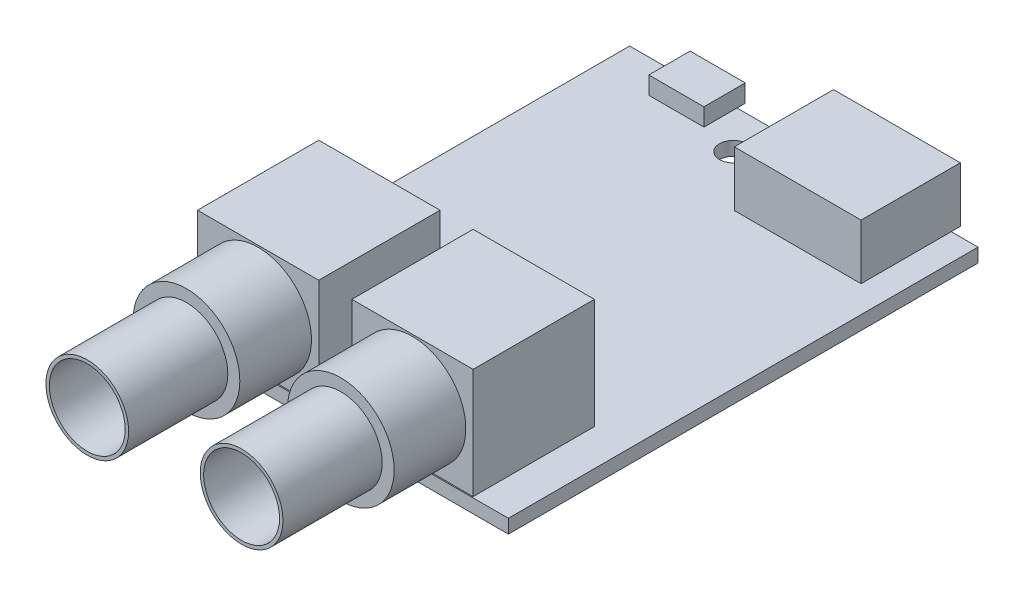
ISO-10303-21;
HEADER;
FILE_DESCRIPTION(('STEP AP214'),'2;1');
FILE_NAME('part.step','',(''),(''),'','','');
FILE_SCHEMA(('AUTOMOTIVE_DESIGN { 1 0 10303 214 1 1 1 1 }'));
ENDSEC;
DATA;
#1=APPLICATION_CONTEXT('core data for automotive mechanical design processes');
#2=APPLICATION_PROTOCOL_DEFINITION('international standard','automotive_design',2000,#1);
#3=PRODUCT_CONTEXT('',#1,'mechanical');
#4=PRODUCT('Part','Part','',(#3));
#5=PRODUCT_RELATED_PRODUCT_CATEGORY('part','',(#4));
#6=PRODUCT_DEFINITION_FORMATION('','',#4);
#7=PRODUCT_DEFINITION_CONTEXT('part definition',#1,'design');
#8=PRODUCT_DEFINITION('design','',#6,#7);
#9=PRODUCT_DEFINITION_SHAPE('','',#8);
#10=(LENGTH_UNIT() NAMED_UNIT(*) SI_UNIT(.MILLI.,.METRE.));
#11=(NAMED_UNIT(*) PLANE_ANGLE_UNIT() SI_UNIT($,.RADIAN.));
#12=(NAMED_UNIT(*) SI_UNIT($,.STERADIAN.) SOLID_ANGLE_UNIT());
#13=UNCERTAINTY_MEASURE_WITH_UNIT(LENGTH_MEASURE(1.E-05),#10,'distance_accuracy_value','');
#14=(GEOMETRIC_REPRESENTATION_CONTEXT(3) GLOBAL_UNCERTAINTY_ASSIGNED_CONTEXT((#13)) GLOBAL_UNIT_ASSIGNED_CONTEXT((#10,
#11,#12)) REPRESENTATION_CONTEXT('',''));
#15=CARTESIAN_POINT('',(0.,0.,0.));
#16=DIRECTION('',(0.,0.,1.));
#17=DIRECTION('',(1.,0.,0.));
#18=AXIS2_PLACEMENT_3D('',#15,#16,#17);
#19=CARTESIAN_POINT('',(0.,0.,0.));
#20=DIRECTION('',(0.,-1.,0.));
#21=DIRECTION('',(0.,0.,-1.));
#22=AXIS2_PLACEMENT_3D('',#19,#20,#21);
#23=PLANE('',#22);
#24=CARTESIAN_POINT('',(-3.556,0.,-22.479));
#25=DIRECTION('',(0.,-1.,0.));
#26=DIRECTION('',(0.,0.,-1.));
#27=AXIS2_PLACEMENT_3D('',#24,#25,#26);
#28=CIRCLE('',#27,1.5875);
#29=CARTESIAN_POINT('',(-3.556,0.,-24.0665));
#30=VERTEX_POINT('',#29);
#31=EDGE_CURVE('E638',#30,#30,#28,.F.);
#32=ORIENTED_EDGE('',*,*,#31,.T.);
#33=EDGE_LOOP('',(#32));
#34=FACE_BOUND('',#33,.T.);
#35=CARTESIAN_POINT('',(-0.381000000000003,0.,9.271));
#36=DIRECTION('',(0.,-1.,0.));
#37=DIRECTION('',(0.,0.,-1.));
#38=AXIS2_PLACEMENT_3D('',#35,#36,#37);
#39=CIRCLE('',#38,1.5875);
#40=CARTESIAN_POINT('',(-0.381000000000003,0.,7.6835));
#41=VERTEX_POINT('',#40);
#42=EDGE_CURVE('E633',#41,#41,#39,.F.);
#43=ORIENTED_EDGE('',*,*,#42,.T.);
#44=EDGE_LOOP('',(#43));
#45=FACE_BOUND('',#44,.T.);
#46=DIRECTION('',(0.,0.,1.));
#47=VECTOR('',#46,1.);
#48=CARTESIAN_POINT('',(-20.066,0.,27.051));
#49=LINE('',#48,#47);
#50=CARTESIAN_POINT('',(-20.066,0.,-27.051));
#51=VERTEX_POINT('',#50);
#52=CARTESIAN_POINT('',(-20.066,0.,27.051));
#53=VERTEX_POINT('',#52);
#54=EDGE_CURVE('E637',#51,#53,#49,.T.);
#55=ORIENTED_EDGE('',*,*,#54,.F.);
#56=DIRECTION('',(-1.,0.,0.));
#57=VECTOR('',#56,1.);
#58=CARTESIAN_POINT('',(-20.066,0.,-27.051));
#59=LINE('',#58,#57);
#60=CARTESIAN_POINT('',(20.066,0.,-27.051));
#61=VERTEX_POINT('',#60);
#62=EDGE_CURVE('E650',#61,#51,#59,.T.);
#63=ORIENTED_EDGE('',*,*,#62,.F.);
#64=DIRECTION('',(0.,0.,-1.));
#65=VECTOR('',#64,1.);
#66=CARTESIAN_POINT('',(20.066,0.,27.051));
#67=LINE('',#66,#65);
#68=CARTESIAN_POINT('',(20.066,0.,27.051));
#69=VERTEX_POINT('',#68);
#70=EDGE_CURVE('E666',#69,#61,#67,.T.);
#71=ORIENTED_EDGE('',*,*,#70,.F.);
#72=DIRECTION('',(1.,0.,0.));
#73=VECTOR('',#72,1.);
#74=CARTESIAN_POINT('',(-20.066,0.,27.051));
#75=LINE('',#74,#73);
#76=EDGE_CURVE('E664',#53,#69,#75,.T.);
#77=ORIENTED_EDGE('',*,*,#76,.F.);
#78=EDGE_LOOP('',(#55,#63,#71,#77));
#79=FACE_BOUND('',#78,.T.);
#80=DIRECTION('',(1.,0.,0.));
#81=VECTOR('',#80,1.);
#82=CARTESIAN_POINT('',(-17.9156348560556,0.,5.69681879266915));
#83=LINE('',#82,#81);
#84=CARTESIAN_POINT('',(-17.9156348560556,0.,5.69681879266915));
#85=VERTEX_POINT('',#84);
#86=CARTESIAN_POINT('',(-15.974437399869,0.,5.69681879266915));
#87=VERTEX_POINT('',#86);
#88=EDGE_CURVE('E432',#85,#87,#83,.T.);
#89=ORIENTED_EDGE('',*,*,#88,.F.);
#90=DIRECTION('',(0.,0.,-1.));
#91=VECTOR('',#90,1.);
#92=CARTESIAN_POINT('',(-17.9156348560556,0.,5.69681879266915));
#93=LINE('',#92,#91);
#94=CARTESIAN_POINT('',(-17.9156348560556,0.,9.70598728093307));
#95=VERTEX_POINT('',#94);
#96=EDGE_CURVE('E418',#95,#85,#93,.T.);
#97=ORIENTED_EDGE('',*,*,#96,.F.);
#98=DIRECTION('',(-1.,0.,0.));
#99=VECTOR('',#98,1.);
#100=CARTESIAN_POINT('',(-17.9156348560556,0.,9.70598728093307));
#101=LINE('',#100,#99);
#102=CARTESIAN_POINT('',(-15.974437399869,0.,9.70598728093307));
#103=VERTEX_POINT('',#102);
#104=EDGE_CURVE('E423',#103,#95,#101,.T.);
#105=ORIENTED_EDGE('',*,*,#104,.F.);
#106=DIRECTION('',(0.,0.,1.));
#107=VECTOR('',#106,1.);
#108=CARTESIAN_POINT('',(-15.974437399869,0.,5.69681879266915));
#109=LINE('',#108,#107);
#110=EDGE_CURVE('E434',#87,#103,#109,.T.);
#111=ORIENTED_EDGE('',*,*,#110,.F.);
#112=EDGE_LOOP('',(#89,#97,#105,#111));
#113=FACE_BOUND('',#112,.T.);
#114=DIRECTION('',(1.,0.,0.));
#115=VECTOR('',#114,1.);
#116=CARTESIAN_POINT('',(9.90819534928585,0.,-4.00916848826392));
#117=LINE('',#116,#115);
#118=CARTESIAN_POINT('',(9.90819534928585,0.,-4.00916848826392));
#119=VERTEX_POINT('',#118);
#120=CARTESIAN_POINT('',(11.8493928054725,0.,-4.00916848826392));
#121=VERTEX_POINT('',#120);
#122=EDGE_CURVE('E403',#119,#121,#117,.T.);
#123=ORIENTED_EDGE('',*,*,#122,.F.);
#124=DIRECTION('',(0.,0.,-1.));
#125=VECTOR('',#124,1.);
#126=CARTESIAN_POINT('',(9.90819534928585,0.,-4.00916848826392));
#127=LINE('',#126,#125);
#128=CARTESIAN_POINT('',(9.90819534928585,0.,0.));
#129=VERTEX_POINT('',#128);
#130=EDGE_CURVE('E389',#129,#119,#127,.T.);
#131=ORIENTED_EDGE('',*,*,#130,.F.);
#132=DIRECTION('',(-1.,0.,0.));
#133=VECTOR('',#132,1.);
#134=CARTESIAN_POINT('',(9.90819534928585,0.,0.));
#135=LINE('',#134,#133);
#136=CARTESIAN_POINT('',(11.8493928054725,0.,0.));
#137=VERTEX_POINT('',#136);
#138=EDGE_CURVE('E394',#137,#129,#135,.T.);
#139=ORIENTED_EDGE('',*,*,#138,.F.);
#140=DIRECTION('',(0.,0.,1.));
#141=VECTOR('',#140,1.);
#142=CARTESIAN_POINT('',(11.8493928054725,0.,-4.00916848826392));
#143=LINE('',#142,#141);
#144=EDGE_CURVE('E405',#121,#137,#143,.T.);
#145=ORIENTED_EDGE('',*,*,#144,.F.);
#146=EDGE_LOOP('',(#123,#131,#139,#145));
#147=FACE_BOUND('',#146,.T.);
#148=DIRECTION('',(1.,0.,0.));
#149=VECTOR('',#148,1.);
#150=CARTESIAN_POINT('',(13.7905902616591,0.,-4.00916848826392));
#151=LINE('',#150,#149);
#152=CARTESIAN_POINT('',(13.7905902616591,0.,-4.00916848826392));
#153=VERTEX_POINT('',#152);
#154=CARTESIAN_POINT('',(15.7317877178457,0.,-4.00916848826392));
#155=VERTEX_POINT('',#154);
#156=EDGE_CURVE('E374',#153,#155,#151,.T.);
#157=ORIENTED_EDGE('',*,*,#156,.F.);
#158=DIRECTION('',(0.,0.,-1.));
#159=VECTOR('',#158,1.);
#160=CARTESIAN_POINT('',(13.7905902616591,0.,-4.00916848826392));
#161=LINE('',#160,#159);
#162=CARTESIAN_POINT('',(13.7905902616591,0.,0.));
#163=VERTEX_POINT('',#162);
#164=EDGE_CURVE('E360',#163,#153,#161,.T.);
#165=ORIENTED_EDGE('',*,*,#164,.F.);
#166=DIRECTION('',(-1.,0.,0.));
#167=VECTOR('',#166,1.);
#168=CARTESIAN_POINT('',(13.7905902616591,0.,0.));
#169=LINE('',#168,#167);
#170=CARTESIAN_POINT('',(15.7317877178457,0.,0.));
#171=VERTEX_POINT('',#170);
#172=EDGE_CURVE('E365',#171,#163,#169,.T.);
#173=ORIENTED_EDGE('',*,*,#172,.F.);
#174=DIRECTION('',(0.,0.,1.));
#175=VECTOR('',#174,1.);
#176=CARTESIAN_POINT('',(15.7317877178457,0.,-4.00916848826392));
#177=LINE('',#176,#175);
#178=EDGE_CURVE('E376',#155,#171,#177,.T.);
#179=ORIENTED_EDGE('',*,*,#178,.F.);
#180=EDGE_LOOP('',(#157,#165,#173,#179));
#181=FACE_BOUND('',#180,.T.);
#182=DIRECTION('',(1.,0.,0.));
#183=VECTOR('',#182,1.);
#184=CARTESIAN_POINT('',(12.981757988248,0.,2.46148969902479));
#185=LINE('',#184,#183);
#186=CARTESIAN_POINT('',(12.981757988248,0.,2.46148969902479));
#187=VERTEX_POINT('',#186);
#188=CARTESIAN_POINT('',(14.9229554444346,0.,2.46148969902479));
#189=VERTEX_POINT('',#188);
#190=EDGE_CURVE('E332',#187,#189,#185,.T.);
#191=ORIENTED_EDGE('',*,*,#190,.F.);
#192=DIRECTION('',(0.,0.,-1.));
#193=VECTOR('',#192,1.);
#194=CARTESIAN_POINT('',(12.981757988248,0.,2.46148969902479));
#195=LINE('',#194,#193);
#196=CARTESIAN_POINT('',(12.981757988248,0.,6.47065818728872));
#197=VERTEX_POINT('',#196);
#198=EDGE_CURVE('E329',#197,#187,#195,.T.);
#199=ORIENTED_EDGE('',*,*,#198,.F.);
#200=DIRECTION('',(-1.,0.,0.));
#201=VECTOR('',#200,1.);
#202=CARTESIAN_POINT('',(12.981757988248,0.,6.47065818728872));
#203=LINE('',#202,#201);
#204=CARTESIAN_POINT('',(14.9229554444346,0.,6.47065818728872));
#205=VERTEX_POINT('',#204);
#206=EDGE_CURVE('E341',#205,#197,#203,.T.);
#207=ORIENTED_EDGE('',*,*,#206,.F.);
#208=DIRECTION('',(0.,0.,1.));
#209=VECTOR('',#208,1.);
#210=CARTESIAN_POINT('',(14.9229554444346,0.,2.46148969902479));
#211=LINE('',#210,#209);
#212=EDGE_CURVE('E349',#189,#205,#211,.T.);
#213=ORIENTED_EDGE('',*,*,#212,.F.);
#214=EDGE_LOOP('',(#191,#199,#207,#213));
#215=FACE_BOUND('',#214,.T.);
#216=DIRECTION('',(1.,0.,0.));
#217=VECTOR('',#216,1.);
#218=CARTESIAN_POINT('',(6.51109980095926,0.,-23.9064424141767));
#219=LINE('',#218,#217);
#220=CARTESIAN_POINT('',(6.51109980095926,0.,-23.9064424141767));
#221=VERTEX_POINT('',#220);
#222=CARTESIAN_POINT('',(10.5202682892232,0.,-23.9064424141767));
#223=VERTEX_POINT('',#222);
#224=EDGE_CURVE('E801',#221,#223,#219,.T.);
#225=ORIENTED_EDGE('',*,*,#224,.F.);
#226=DIRECTION('',(0.,0.,-1.));
#227=VECTOR('',#226,1.);
#228=CARTESIAN_POINT('',(6.51109980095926,0.,-23.9064424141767));
#229=LINE('',#228,#227);
#230=CARTESIAN_POINT('',(6.51109980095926,0.,-21.9652449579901));
#231=VERTEX_POINT('',#230);
#232=EDGE_CURVE('E327',#231,#221,#229,.T.);
#233=ORIENTED_EDGE('',*,*,#232,.F.);
#234=DIRECTION('',(-1.,0.,0.));
#235=VECTOR('',#234,1.);
#236=CARTESIAN_POINT('',(6.51109980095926,0.,-21.9652449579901));
#237=LINE('',#236,#235);
#238=CARTESIAN_POINT('',(10.5202682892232,0.,-21.9652449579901));
#239=VERTEX_POINT('',#238);
#240=EDGE_CURVE('E323',#239,#231,#237,.T.);
#241=ORIENTED_EDGE('',*,*,#240,.F.);
#242=DIRECTION('',(0.,0.,1.));
#243=VECTOR('',#242,1.);
#244=CARTESIAN_POINT('',(10.5202682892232,0.,-23.9064424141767));
#245=LINE('',#244,#243);
#246=EDGE_CURVE('E803',#223,#239,#245,.T.);
#247=ORIENTED_EDGE('',*,*,#246,.F.);
#248=EDGE_LOOP('',(#225,#233,#241,#247));
#249=FACE_BOUND('',#248,.T.);
#250=ADVANCED_FACE('F33',(#34,#45,#79,#113,#147,#181,#215,#249),#23,.T.);
#251=CARTESIAN_POINT('',(0.,1.5875,0.));
#252=DIRECTION('',(0.,-1.,0.));
#253=DIRECTION('',(0.,0.,-1.));
#254=AXIS2_PLACEMENT_3D('',#251,#252,#253);
#255=PLANE('',#254);
#256=DIRECTION('',(0.,0.,1.));
#257=VECTOR('',#256,1.);
#258=CARTESIAN_POINT('',(-15.875,1.5875,26.924));
#259=LINE('',#258,#257);
#260=CARTESIAN_POINT('',(-15.875,1.5875,12.954));
#261=VERTEX_POINT('',#260);
#262=CARTESIAN_POINT('',(-15.875,1.5875,26.924));
#263=VERTEX_POINT('',#262);
#264=EDGE_CURVE('E532',#261,#263,#259,.T.);
#265=ORIENTED_EDGE('',*,*,#264,.F.);
#266=DIRECTION('',(-1.,0.,0.));
#267=VECTOR('',#266,1.);
#268=CARTESIAN_POINT('',(-15.875,1.5875,12.954));
#269=LINE('',#268,#267);
#270=CARTESIAN_POINT('',(-1.905,1.5875,12.954));
#271=VERTEX_POINT('',#270);
#272=EDGE_CURVE('E537',#271,#261,#269,.T.);
#273=ORIENTED_EDGE('',*,*,#272,.F.);
#274=DIRECTION('',(0.,0.,-1.));
#275=VECTOR('',#274,1.);
#276=CARTESIAN_POINT('',(-1.905,1.5875,26.924));
#277=LINE('',#276,#275);
#278=CARTESIAN_POINT('',(-1.905,1.5875,26.924));
#279=VERTEX_POINT('',#278);
#280=EDGE_CURVE('E549',#279,#271,#277,.T.);
#281=ORIENTED_EDGE('',*,*,#280,.F.);
#282=DIRECTION('',(1.,0.,0.));
#283=VECTOR('',#282,1.);
#284=CARTESIAN_POINT('',(-15.875,1.5875,26.924));
#285=LINE('',#284,#283);
#286=EDGE_CURVE('E546',#263,#279,#285,.T.);
#287=ORIENTED_EDGE('',*,*,#286,.F.);
#288=EDGE_LOOP('',(#265,#273,#281,#287));
#289=FACE_BOUND('',#288,.T.);
#290=CARTESIAN_POINT('',(-3.556,1.5875,-22.479));
#291=DIRECTION('',(0.,1.,0.));
#292=DIRECTION('',(0.,0.,1.));
#293=AXIS2_PLACEMENT_3D('',#290,#291,#292);
#294=CIRCLE('',#293,1.5875);
#295=CARTESIAN_POINT('',(-3.556,1.5875,-20.8915));
#296=VERTEX_POINT('',#295);
#297=EDGE_CURVE('E634',#296,#296,#294,.T.);
#298=ORIENTED_EDGE('',*,*,#297,.F.);
#299=EDGE_LOOP('',(#298));
#300=FACE_BOUND('',#299,.T.);
#301=CARTESIAN_POINT('',(-0.381000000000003,1.5875,9.271));
#302=DIRECTION('',(0.,1.,0.));
#303=DIRECTION('',(0.,0.,1.));
#304=AXIS2_PLACEMENT_3D('',#301,#302,#303);
#305=CIRCLE('',#304,1.5875);
#306=CARTESIAN_POINT('',(-0.381000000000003,1.5875,10.8585));
#307=VERTEX_POINT('',#306);
#308=EDGE_CURVE('E641',#307,#307,#305,.T.);
#309=ORIENTED_EDGE('',*,*,#308,.F.);
#310=EDGE_LOOP('',(#309));
#311=FACE_BOUND('',#310,.T.);
#312=DIRECTION('',(0.,0.,1.));
#313=VECTOR('',#312,1.);
#314=CARTESIAN_POINT('',(2.37670649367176,1.5875,-16.6676384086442));
#315=LINE('',#314,#313);
#316=CARTESIAN_POINT('',(2.37670649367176,1.5875,-27.051));
#317=VERTEX_POINT('',#316);
#318=CARTESIAN_POINT('',(2.37670649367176,1.5875,-16.6676384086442));
#319=VERTEX_POINT('',#318);
#320=EDGE_CURVE('E565',#317,#319,#315,.T.);
#321=ORIENTED_EDGE('',*,*,#320,.F.);
#322=DIRECTION('',(-1.,0.,0.));
#323=VECTOR('',#322,1.);
#324=CARTESIAN_POINT('',(-20.066,1.5875,-27.051));
#325=LINE('',#324,#323);
#326=CARTESIAN_POINT('',(-7.69484671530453,1.5875,-27.051));
#327=VERTEX_POINT('',#326);
#328=EDGE_CURVE('E660',#317,#327,#325,.T.);
#329=ORIENTED_EDGE('',*,*,#328,.T.);
#330=DIRECTION('',(0.,0.,-1.));
#331=VECTOR('',#330,1.);
#332=CARTESIAN_POINT('',(-7.69484671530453,1.5875,-23.2351609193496));
#333=LINE('',#332,#331);
#334=CARTESIAN_POINT('',(-7.69484671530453,1.5875,-23.2351609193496));
#335=VERTEX_POINT('',#334);
#336=EDGE_CURVE('E618',#335,#327,#333,.T.);
#337=ORIENTED_EDGE('',*,*,#336,.F.);
#338=DIRECTION('',(1.,0.,0.));
#339=VECTOR('',#338,1.);
#340=CARTESIAN_POINT('',(-14.0448467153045,1.5875,-23.2351609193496));
#341=LINE('',#340,#339);
#342=CARTESIAN_POINT('',(-14.0448467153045,1.5875,-23.2351609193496));
#343=VERTEX_POINT('',#342);
#344=EDGE_CURVE('E613',#343,#335,#341,.T.);
#345=ORIENTED_EDGE('',*,*,#344,.F.);
#346=DIRECTION('',(0.,0.,1.));
#347=VECTOR('',#346,1.);
#348=CARTESIAN_POINT('',(-14.0448467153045,1.5875,-23.2351609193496));
#349=LINE('',#348,#347);
#350=CARTESIAN_POINT('',(-14.0448467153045,1.5875,-27.051));
#351=VERTEX_POINT('',#350);
#352=EDGE_CURVE('E614',#351,#343,#349,.T.);
#353=ORIENTED_EDGE('',*,*,#352,.F.);
#354=CARTESIAN_POINT('',(-20.066,1.5875,-27.051));
#355=VERTEX_POINT('',#354);
#356=EDGE_CURVE('E654',#351,#355,#325,.T.);
#357=ORIENTED_EDGE('',*,*,#356,.T.);
#358=DIRECTION('',(0.,0.,1.));
#359=VECTOR('',#358,1.);
#360=CARTESIAN_POINT('',(-20.066,1.5875,27.051));
#361=LINE('',#360,#359);
#362=CARTESIAN_POINT('',(-20.066,1.5875,27.051));
#363=VERTEX_POINT('',#362);
#364=EDGE_CURVE('E646',#355,#363,#361,.T.);
#365=ORIENTED_EDGE('',*,*,#364,.T.);
#366=DIRECTION('',(1.,0.,0.));
#367=VECTOR('',#366,1.);
#368=CARTESIAN_POINT('',(-20.066,1.5875,27.051));
#369=LINE('',#368,#367);
#370=CARTESIAN_POINT('',(20.066,1.5875,27.051));
#371=VERTEX_POINT('',#370);
#372=EDGE_CURVE('E649',#363,#371,#369,.T.);
#373=ORIENTED_EDGE('',*,*,#372,.T.);
#374=DIRECTION('',(0.,0.,-1.));
#375=VECTOR('',#374,1.);
#376=CARTESIAN_POINT('',(20.066,1.5875,27.051));
#377=LINE('',#376,#375);
#378=CARTESIAN_POINT('',(20.066,1.5875,-27.051));
#379=VERTEX_POINT('',#378);
#380=EDGE_CURVE('E652',#371,#379,#377,.T.);
#381=ORIENTED_EDGE('',*,*,#380,.T.);
#382=CARTESIAN_POINT('',(16.9817064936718,1.5875,-27.051));
#383=VERTEX_POINT('',#382);
#384=EDGE_CURVE('E655',#379,#383,#325,.T.);
#385=ORIENTED_EDGE('',*,*,#384,.T.);
#386=DIRECTION('',(0.,0.,-1.));
#387=VECTOR('',#386,1.);
#388=CARTESIAN_POINT('',(16.9817064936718,1.5875,-16.6676384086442));
#389=LINE('',#388,#387);
#390=CARTESIAN_POINT('',(16.9817064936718,1.5875,-16.6676384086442));
#391=VERTEX_POINT('',#390);
#392=EDGE_CURVE('E584',#391,#383,#389,.T.);
#393=ORIENTED_EDGE('',*,*,#392,.F.);
#394=DIRECTION('',(1.,0.,0.));
#395=VECTOR('',#394,1.);
#396=CARTESIAN_POINT('',(2.37670649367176,1.5875,-16.6676384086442));
#397=LINE('',#396,#395);
#398=EDGE_CURVE('E580',#319,#391,#397,.T.);
#399=ORIENTED_EDGE('',*,*,#398,.F.);
#400=EDGE_LOOP('',(#321,#329,#337,#345,#353,#357,#365,#373,#381,#385,#393,#399));
#401=FACE_BOUND('',#400,.T.);
#402=DIRECTION('',(0.,0.,1.));
#403=VECTOR('',#402,1.);
#404=CARTESIAN_POINT('',(1.90499999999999,1.5875,26.924));
#405=LINE('',#404,#403);
#406=CARTESIAN_POINT('',(1.90499999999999,1.5875,12.954));
#407=VERTEX_POINT('',#406);
#408=CARTESIAN_POINT('',(1.90499999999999,1.5875,26.924));
#409=VERTEX_POINT('',#408);
#410=EDGE_CURVE('E471',#407,#409,#405,.T.);
#411=ORIENTED_EDGE('',*,*,#410,.F.);
#412=DIRECTION('',(-1.,0.,0.));
#413=VECTOR('',#412,1.);
#414=CARTESIAN_POINT('',(1.90499999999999,1.5875,12.954));
#415=LINE('',#414,#413);
#416=CARTESIAN_POINT('',(15.875,1.5875,12.954));
#417=VERTEX_POINT('',#416);
#418=EDGE_CURVE('E476',#417,#407,#415,.T.);
#419=ORIENTED_EDGE('',*,*,#418,.F.);
#420=DIRECTION('',(0.,0.,-1.));
#421=VECTOR('',#420,1.);
#422=CARTESIAN_POINT('',(15.875,1.5875,26.924));
#423=LINE('',#422,#421);
#424=CARTESIAN_POINT('',(15.875,1.5875,26.924));
#425=VERTEX_POINT('',#424);
#426=EDGE_CURVE('E488',#425,#417,#423,.T.);
#427=ORIENTED_EDGE('',*,*,#426,.F.);
#428=DIRECTION('',(1.,0.,0.));
#429=VECTOR('',#428,1.);
#430=CARTESIAN_POINT('',(1.90499999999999,1.5875,26.924));
#431=LINE('',#430,#429);
#432=EDGE_CURVE('E485',#409,#425,#431,.T.);
#433=ORIENTED_EDGE('',*,*,#432,.F.);
#434=EDGE_LOOP('',(#411,#419,#427,#433));
#435=FACE_BOUND('',#434,.T.);
#436=ADVANCED_FACE('F729',(#289,#300,#311,#401,#435),#255,.F.);
#437=CARTESIAN_POINT('',(-20.066,1.5875,27.051));
#438=DIRECTION('',(1.,0.,0.));
#439=DIRECTION('',(0.,0.,-1.));
#440=AXIS2_PLACEMENT_3D('',#437,#438,#439);
#441=PLANE('',#440);
#442=ORIENTED_EDGE('',*,*,#54,.T.);
#443=DIRECTION('',(0.,-1.,0.));
#444=VECTOR('',#443,1.);
#445=CARTESIAN_POINT('',(-20.066,1.5875,27.051));
#446=LINE('',#445,#444);
#447=EDGE_CURVE('E677',#363,#53,#446,.T.);
#448=ORIENTED_EDGE('',*,*,#447,.F.);
#449=ORIENTED_EDGE('',*,*,#364,.F.);
#450=DIRECTION('',(0.,-1.,0.));
#451=VECTOR('',#450,1.);
#452=CARTESIAN_POINT('',(-20.066,1.5875,-27.051));
#453=LINE('',#452,#451);
#454=EDGE_CURVE('E658',#355,#51,#453,.T.);
#455=ORIENTED_EDGE('',*,*,#454,.T.);
#456=EDGE_LOOP('',(#442,#448,#449,#455));
#457=FACE_BOUND('',#456,.T.);
#458=ADVANCED_FACE('F35',(#457),#441,.F.);
#459=CARTESIAN_POINT('',(-20.066,1.5875,27.051));
#460=DIRECTION('',(0.,0.,-1.));
#461=DIRECTION('',(-1.,0.,0.));
#462=AXIS2_PLACEMENT_3D('',#459,#460,#461);
#463=PLANE('',#462);
#464=ORIENTED_EDGE('',*,*,#76,.T.);
#465=DIRECTION('',(0.,-1.,0.));
#466=VECTOR('',#465,1.);
#467=CARTESIAN_POINT('',(20.066,1.5875,27.051));
#468=LINE('',#467,#466);
#469=EDGE_CURVE('E674',#371,#69,#468,.T.);
#470=ORIENTED_EDGE('',*,*,#469,.F.);
#471=ORIENTED_EDGE('',*,*,#372,.F.);
#472=ORIENTED_EDGE('',*,*,#447,.T.);
#473=EDGE_LOOP('',(#464,#470,#471,#472));
#474=FACE_BOUND('',#473,.T.);
#475=ADVANCED_FACE('F766',(#474),#463,.F.);
#476=CARTESIAN_POINT('',(20.066,1.5875,27.051));
#477=DIRECTION('',(-1.,0.,0.));
#478=DIRECTION('',(0.,0.,1.));
#479=AXIS2_PLACEMENT_3D('',#476,#477,#478);
#480=PLANE('',#479);
#481=ORIENTED_EDGE('',*,*,#70,.T.);
#482=DIRECTION('',(0.,-1.,0.));
#483=VECTOR('',#482,1.);
#484=CARTESIAN_POINT('',(20.066,1.5875,-27.051));
#485=LINE('',#484,#483);
#486=EDGE_CURVE('E671',#379,#61,#485,.T.);
#487=ORIENTED_EDGE('',*,*,#486,.F.);
#488=ORIENTED_EDGE('',*,*,#380,.F.);
#489=ORIENTED_EDGE('',*,*,#469,.T.);
#490=EDGE_LOOP('',(#481,#487,#488,#489));
#491=FACE_BOUND('',#490,.T.);
#492=ADVANCED_FACE('F764',(#491),#480,.F.);
#493=CARTESIAN_POINT('',(-20.066,1.5875,-27.051));
#494=DIRECTION('',(0.,0.,1.));
#495=DIRECTION('',(1.,0.,0.));
#496=AXIS2_PLACEMENT_3D('',#493,#494,#495);
#497=PLANE('',#496);
#498=ORIENTED_EDGE('',*,*,#62,.T.);
#499=ORIENTED_EDGE('',*,*,#454,.F.);
#500=ORIENTED_EDGE('',*,*,#356,.F.);
#501=EDGE_CURVE('E661',#327,#351,#325,.T.);
#502=ORIENTED_EDGE('',*,*,#501,.F.);
#503=ORIENTED_EDGE('',*,*,#328,.F.);
#504=EDGE_CURVE('E659',#383,#317,#325,.T.);
#505=ORIENTED_EDGE('',*,*,#504,.F.);
#506=ORIENTED_EDGE('',*,*,#384,.F.);
#507=ORIENTED_EDGE('',*,*,#486,.T.);
#508=EDGE_LOOP('',(#498,#499,#500,#502,#503,#505,#506,#507));
#509=FACE_BOUND('',#508,.T.);
#510=ADVANCED_FACE('F760',(#509),#497,.F.);
#511=CARTESIAN_POINT('',(-0.381000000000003,-0.000999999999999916,9.271));
#512=DIRECTION('',(0.,1.,0.));
#513=DIRECTION('',(0.,0.,1.));
#514=AXIS2_PLACEMENT_3D('',#511,#512,#513);
#515=CYLINDRICAL_SURFACE('',#514,1.5875);
#516=ORIENTED_EDGE('',*,*,#42,.F.);
#517=EDGE_LOOP('',(#516));
#518=FACE_BOUND('',#517,.T.);
#519=ORIENTED_EDGE('',*,*,#308,.T.);
#520=EDGE_LOOP('',(#519));
#521=FACE_BOUND('',#520,.T.);
#522=ADVANCED_FACE('F763',(#518,#521),#515,.F.);
#523=CARTESIAN_POINT('',(-3.556,-0.000999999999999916,-22.479));
#524=DIRECTION('',(0.,1.,0.));
#525=DIRECTION('',(0.,0.,1.));
#526=AXIS2_PLACEMENT_3D('',#523,#524,#525);
#527=CYLINDRICAL_SURFACE('',#526,1.5875);
#528=ORIENTED_EDGE('',*,*,#31,.F.);
#529=EDGE_LOOP('',(#528));
#530=FACE_BOUND('',#529,.T.);
#531=ORIENTED_EDGE('',*,*,#297,.T.);
#532=EDGE_LOOP('',(#531));
#533=FACE_BOUND('',#532,.T.);
#534=ADVANCED_FACE('F1037',(#530,#533),#527,.F.);
#535=CARTESIAN_POINT('',(-14.0448467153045,3.6195,-23.2351609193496));
#536=DIRECTION('',(1.,0.,0.));
#537=DIRECTION('',(0.,0.,-1.));
#538=AXIS2_PLACEMENT_3D('',#535,#536,#537);
#539=PLANE('',#538);
#540=CARTESIAN_POINT('',(-14.0448467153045,1.5875,-27.9976609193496));
#541=VERTEX_POINT('',#540);
#542=EDGE_CURVE('E599',#541,#351,#349,.T.);
#543=ORIENTED_EDGE('',*,*,#542,.T.);
#544=ORIENTED_EDGE('',*,*,#352,.T.);
#545=DIRECTION('',(0.,-1.,0.));
#546=VECTOR('',#545,1.);
#547=CARTESIAN_POINT('',(-14.0448467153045,3.6195,-23.2351609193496));
#548=LINE('',#547,#546);
#549=CARTESIAN_POINT('',(-14.0448467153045,3.6195,-23.2351609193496));
#550=VERTEX_POINT('',#549);
#551=EDGE_CURVE('E630',#550,#343,#548,.T.);
#552=ORIENTED_EDGE('',*,*,#551,.F.);
#553=DIRECTION('',(0.,0.,1.));
#554=VECTOR('',#553,1.);
#555=CARTESIAN_POINT('',(-14.0448467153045,3.6195,-23.2351609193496));
#556=LINE('',#555,#554);
#557=CARTESIAN_POINT('',(-14.0448467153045,3.6195,-27.9976609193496));
#558=VERTEX_POINT('',#557);
#559=EDGE_CURVE('E600',#558,#550,#556,.T.);
#560=ORIENTED_EDGE('',*,*,#559,.F.);
#561=DIRECTION('',(0.,-1.,0.));
#562=VECTOR('',#561,1.);
#563=CARTESIAN_POINT('',(-14.0448467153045,3.6195,-27.9976609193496));
#564=LINE('',#563,#562);
#565=EDGE_CURVE('E610',#558,#541,#564,.T.);
#566=ORIENTED_EDGE('',*,*,#565,.T.);
#567=EDGE_LOOP('',(#543,#544,#552,#560,#566));
#568=FACE_BOUND('',#567,.T.);
#569=ADVANCED_FACE('F685',(#568),#539,.F.);
#570=CARTESIAN_POINT('',(-14.0448467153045,3.6195,-23.2351609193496));
#571=DIRECTION('',(0.,0.,-1.));
#572=DIRECTION('',(-1.,0.,0.));
#573=AXIS2_PLACEMENT_3D('',#570,#571,#572);
#574=PLANE('',#573);
#575=ORIENTED_EDGE('',*,*,#344,.T.);
#576=DIRECTION('',(0.,-1.,0.));
#577=VECTOR('',#576,1.);
#578=CARTESIAN_POINT('',(-7.69484671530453,3.6195,-23.2351609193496));
#579=LINE('',#578,#577);
#580=CARTESIAN_POINT('',(-7.69484671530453,3.6195,-23.2351609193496));
#581=VERTEX_POINT('',#580);
#582=EDGE_CURVE('E627',#581,#335,#579,.T.);
#583=ORIENTED_EDGE('',*,*,#582,.F.);
#584=DIRECTION('',(1.,0.,0.));
#585=VECTOR('',#584,1.);
#586=CARTESIAN_POINT('',(-14.0448467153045,3.6195,-23.2351609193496));
#587=LINE('',#586,#585);
#588=EDGE_CURVE('E603',#550,#581,#587,.T.);
#589=ORIENTED_EDGE('',*,*,#588,.F.);
#590=ORIENTED_EDGE('',*,*,#551,.T.);
#591=EDGE_LOOP('',(#575,#583,#589,#590));
#592=FACE_BOUND('',#591,.T.);
#593=ADVANCED_FACE('F691',(#592),#574,.F.);
#594=CARTESIAN_POINT('',(-7.69484671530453,3.6195,-23.2351609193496));
#595=DIRECTION('',(-1.,0.,0.));
#596=DIRECTION('',(0.,0.,1.));
#597=AXIS2_PLACEMENT_3D('',#594,#595,#596);
#598=PLANE('',#597);
#599=ORIENTED_EDGE('',*,*,#336,.T.);
#600=CARTESIAN_POINT('',(-7.69484671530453,1.5875,-27.9976609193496));
#601=VERTEX_POINT('',#600);
#602=EDGE_CURVE('E617',#327,#601,#333,.T.);
#603=ORIENTED_EDGE('',*,*,#602,.T.);
#604=DIRECTION('',(0.,-1.,0.));
#605=VECTOR('',#604,1.);
#606=CARTESIAN_POINT('',(-7.69484671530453,3.6195,-27.9976609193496));
#607=LINE('',#606,#605);
#608=CARTESIAN_POINT('',(-7.69484671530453,3.6195,-27.9976609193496));
#609=VERTEX_POINT('',#608);
#610=EDGE_CURVE('E624',#609,#601,#607,.T.);
#611=ORIENTED_EDGE('',*,*,#610,.F.);
#612=DIRECTION('',(0.,0.,-1.));
#613=VECTOR('',#612,1.);
#614=CARTESIAN_POINT('',(-7.69484671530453,3.6195,-23.2351609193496));
#615=LINE('',#614,#613);
#616=EDGE_CURVE('E606',#581,#609,#615,.T.);
#617=ORIENTED_EDGE('',*,*,#616,.F.);
#618=ORIENTED_EDGE('',*,*,#582,.T.);
#619=EDGE_LOOP('',(#599,#603,#611,#617,#618));
#620=FACE_BOUND('',#619,.T.);
#621=ADVANCED_FACE('F1050',(#620),#598,.F.);
#622=CARTESIAN_POINT('',(-14.0448467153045,3.6195,-27.9976609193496));
#623=DIRECTION('',(0.,0.,1.));
#624=DIRECTION('',(1.,0.,0.));
#625=AXIS2_PLACEMENT_3D('',#622,#623,#624);
#626=PLANE('',#625);
#627=DIRECTION('',(-1.,0.,0.));
#628=VECTOR('',#627,1.);
#629=CARTESIAN_POINT('',(-14.0448467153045,1.5875,-27.9976609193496));
#630=LINE('',#629,#628);
#631=EDGE_CURVE('E604',#601,#541,#630,.T.);
#632=ORIENTED_EDGE('',*,*,#631,.T.);
#633=ORIENTED_EDGE('',*,*,#565,.F.);
#634=DIRECTION('',(-1.,0.,0.));
#635=VECTOR('',#634,1.);
#636=CARTESIAN_POINT('',(-14.0448467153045,3.6195,-27.9976609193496));
#637=LINE('',#636,#635);
#638=EDGE_CURVE('E608',#609,#558,#637,.T.);
#639=ORIENTED_EDGE('',*,*,#638,.F.);
#640=ORIENTED_EDGE('',*,*,#610,.T.);
#641=EDGE_LOOP('',(#632,#633,#639,#640));
#642=FACE_BOUND('',#641,.T.);
#643=ADVANCED_FACE('F1053',(#642),#626,.F.);
#644=CARTESIAN_POINT('',(0.,3.6195,0.));
#645=DIRECTION('',(0.,-1.,0.));
#646=DIRECTION('',(0.,0.,-1.));
#647=AXIS2_PLACEMENT_3D('',#644,#645,#646);
#648=PLANE('',#647);
#649=ORIENTED_EDGE('',*,*,#559,.T.);
#650=ORIENTED_EDGE('',*,*,#588,.T.);
#651=ORIENTED_EDGE('',*,*,#616,.T.);
#652=ORIENTED_EDGE('',*,*,#638,.T.);
#653=EDGE_LOOP('',(#649,#650,#651,#652));
#654=FACE_BOUND('',#653,.T.);
#655=ADVANCED_FACE('F695',(#654),#648,.F.);
#656=CARTESIAN_POINT('',(0.,1.5875,0.));
#657=DIRECTION('',(0.,-1.,0.));
#658=DIRECTION('',(0.,0.,-1.));
#659=AXIS2_PLACEMENT_3D('',#656,#657,#658);
#660=PLANE('',#659);
#661=ORIENTED_EDGE('',*,*,#602,.F.);
#662=ORIENTED_EDGE('',*,*,#501,.T.);
#663=ORIENTED_EDGE('',*,*,#542,.F.);
#664=ORIENTED_EDGE('',*,*,#631,.F.);
#665=EDGE_LOOP('',(#661,#662,#663,#664));
#666=FACE_BOUND('',#665,.T.);
#667=ADVANCED_FACE('F703',(#666),#660,.T.);
#668=CARTESIAN_POINT('',(0.,1.5875,0.));
#669=DIRECTION('',(0.,-1.,0.));
#670=DIRECTION('',(0.,0.,-1.));
#671=AXIS2_PLACEMENT_3D('',#668,#669,#670);
#672=PLANE('',#671);
#673=ORIENTED_EDGE('',*,*,#504,.T.);
#674=CARTESIAN_POINT('',(2.37670649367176,1.5875,-28.0976384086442));
#675=VERTEX_POINT('',#674);
#676=EDGE_CURVE('E577',#675,#317,#315,.T.);
#677=ORIENTED_EDGE('',*,*,#676,.F.);
#678=DIRECTION('',(-1.,0.,0.));
#679=VECTOR('',#678,1.);
#680=CARTESIAN_POINT('',(2.37670649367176,1.5875,-28.0976384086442));
#681=LINE('',#680,#679);
#682=CARTESIAN_POINT('',(16.9817064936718,1.5875,-28.0976384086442));
#683=VERTEX_POINT('',#682);
#684=EDGE_CURVE('E570',#683,#675,#681,.T.);
#685=ORIENTED_EDGE('',*,*,#684,.F.);
#686=EDGE_CURVE('E583',#383,#683,#389,.T.);
#687=ORIENTED_EDGE('',*,*,#686,.F.);
#688=EDGE_LOOP('',(#673,#677,#685,#687));
#689=FACE_BOUND('',#688,.T.);
#690=ADVANCED_FACE('F711',(#689),#672,.T.);
#691=CARTESIAN_POINT('',(2.37670649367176,7.9375,-16.6676384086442));
#692=DIRECTION('',(1.,0.,0.));
#693=DIRECTION('',(0.,0.,-1.));
#694=AXIS2_PLACEMENT_3D('',#691,#692,#693);
#695=PLANE('',#694);
#696=ORIENTED_EDGE('',*,*,#676,.T.);
#697=ORIENTED_EDGE('',*,*,#320,.T.);
#698=DIRECTION('',(0.,-1.,0.));
#699=VECTOR('',#698,1.);
#700=CARTESIAN_POINT('',(2.37670649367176,7.9375,-16.6676384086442));
#701=LINE('',#700,#699);
#702=CARTESIAN_POINT('',(2.37670649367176,7.9375,-16.6676384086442));
#703=VERTEX_POINT('',#702);
#704=EDGE_CURVE('E596',#703,#319,#701,.T.);
#705=ORIENTED_EDGE('',*,*,#704,.F.);
#706=DIRECTION('',(0.,0.,1.));
#707=VECTOR('',#706,1.);
#708=CARTESIAN_POINT('',(2.37670649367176,7.9375,-16.6676384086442));
#709=LINE('',#708,#707);
#710=CARTESIAN_POINT('',(2.37670649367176,7.9375,-28.0976384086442));
#711=VERTEX_POINT('',#710);
#712=EDGE_CURVE('E566',#711,#703,#709,.T.);
#713=ORIENTED_EDGE('',*,*,#712,.F.);
#714=DIRECTION('',(0.,-1.,0.));
#715=VECTOR('',#714,1.);
#716=CARTESIAN_POINT('',(2.37670649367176,7.9375,-28.0976384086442));
#717=LINE('',#716,#715);
#718=EDGE_CURVE('E576',#711,#675,#717,.T.);
#719=ORIENTED_EDGE('',*,*,#718,.T.);
#720=EDGE_LOOP('',(#696,#697,#705,#713,#719));
#721=FACE_BOUND('',#720,.T.);
#722=ADVANCED_FACE('F716',(#721),#695,.F.);
#723=CARTESIAN_POINT('',(2.37670649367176,7.9375,-16.6676384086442));
#724=DIRECTION('',(0.,0.,-1.));
#725=DIRECTION('',(-1.,0.,0.));
#726=AXIS2_PLACEMENT_3D('',#723,#724,#725);
#727=PLANE('',#726);
#728=ORIENTED_EDGE('',*,*,#398,.T.);
#729=DIRECTION('',(0.,-1.,0.));
#730=VECTOR('',#729,1.);
#731=CARTESIAN_POINT('',(16.9817064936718,7.9375,-16.6676384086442));
#732=LINE('',#731,#730);
#733=CARTESIAN_POINT('',(16.9817064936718,7.9375,-16.6676384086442));
#734=VERTEX_POINT('',#733);
#735=EDGE_CURVE('E593',#734,#391,#732,.T.);
#736=ORIENTED_EDGE('',*,*,#735,.F.);
#737=DIRECTION('',(1.,0.,0.));
#738=VECTOR('',#737,1.);
#739=CARTESIAN_POINT('',(2.37670649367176,7.9375,-16.6676384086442));
#740=LINE('',#739,#738);
#741=EDGE_CURVE('E569',#703,#734,#740,.T.);
#742=ORIENTED_EDGE('',*,*,#741,.F.);
#743=ORIENTED_EDGE('',*,*,#704,.T.);
#744=EDGE_LOOP('',(#728,#736,#742,#743));
#745=FACE_BOUND('',#744,.T.);
#746=ADVANCED_FACE('F732',(#745),#727,.F.);
#747=CARTESIAN_POINT('',(16.9817064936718,7.9375,-16.6676384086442));
#748=DIRECTION('',(-1.,0.,0.));
#749=DIRECTION('',(0.,0.,1.));
#750=AXIS2_PLACEMENT_3D('',#747,#748,#749);
#751=PLANE('',#750);
#752=ORIENTED_EDGE('',*,*,#392,.T.);
#753=ORIENTED_EDGE('',*,*,#686,.T.);
#754=DIRECTION('',(0.,-1.,0.));
#755=VECTOR('',#754,1.);
#756=CARTESIAN_POINT('',(16.9817064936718,7.9375,-28.0976384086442));
#757=LINE('',#756,#755);
#758=CARTESIAN_POINT('',(16.9817064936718,7.9375,-28.0976384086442));
#759=VERTEX_POINT('',#758);
#760=EDGE_CURVE('E590',#759,#683,#757,.T.);
#761=ORIENTED_EDGE('',*,*,#760,.F.);
#762=DIRECTION('',(0.,0.,-1.));
#763=VECTOR('',#762,1.);
#764=CARTESIAN_POINT('',(16.9817064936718,7.9375,-16.6676384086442));
#765=LINE('',#764,#763);
#766=EDGE_CURVE('E572',#734,#759,#765,.T.);
#767=ORIENTED_EDGE('',*,*,#766,.F.);
#768=ORIENTED_EDGE('',*,*,#735,.T.);
#769=EDGE_LOOP('',(#752,#753,#761,#767,#768));
#770=FACE_BOUND('',#769,.T.);
#771=ADVANCED_FACE('F727',(#770),#751,.F.);
#772=CARTESIAN_POINT('',(2.37670649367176,7.9375,-28.0976384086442));
#773=DIRECTION('',(0.,0.,1.));
#774=DIRECTION('',(1.,0.,0.));
#775=AXIS2_PLACEMENT_3D('',#772,#773,#774);
#776=PLANE('',#775);
#777=ORIENTED_EDGE('',*,*,#684,.T.);
#778=ORIENTED_EDGE('',*,*,#718,.F.);
#779=DIRECTION('',(-1.,0.,0.));
#780=VECTOR('',#779,1.);
#781=CARTESIAN_POINT('',(2.37670649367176,7.9375,-28.0976384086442));
#782=LINE('',#781,#780);
#783=EDGE_CURVE('E574',#759,#711,#782,.T.);
#784=ORIENTED_EDGE('',*,*,#783,.F.);
#785=ORIENTED_EDGE('',*,*,#760,.T.);
#786=EDGE_LOOP('',(#777,#778,#784,#785));
#787=FACE_BOUND('',#786,.T.);
#788=ADVANCED_FACE('F723',(#787),#776,.F.);
#789=CARTESIAN_POINT('',(0.,7.9375,0.));
#790=DIRECTION('',(0.,-1.,0.));
#791=DIRECTION('',(0.,0.,-1.));
#792=AXIS2_PLACEMENT_3D('',#789,#790,#791);
#793=PLANE('',#792);
#794=ORIENTED_EDGE('',*,*,#712,.T.);
#795=ORIENTED_EDGE('',*,*,#741,.T.);
#796=ORIENTED_EDGE('',*,*,#766,.T.);
#797=ORIENTED_EDGE('',*,*,#783,.T.);
#798=EDGE_LOOP('',(#794,#795,#796,#797));
#799=FACE_BOUND('',#798,.T.);
#800=ADVANCED_FACE('F734',(#799),#793,.F.);
#801=CARTESIAN_POINT('',(-15.875,14.2875,26.924));
#802=DIRECTION('',(1.,0.,0.));
#803=DIRECTION('',(0.,0.,-1.));
#804=AXIS2_PLACEMENT_3D('',#801,#802,#803);
#805=PLANE('',#804);
#806=ORIENTED_EDGE('',*,*,#264,.T.);
#807=DIRECTION('',(0.,-1.,0.));
#808=VECTOR('',#807,1.);
#809=CARTESIAN_POINT('',(-15.875,14.2875,26.924));
#810=LINE('',#809,#808);
#811=CARTESIAN_POINT('',(-15.875,14.2875,26.924));
#812=VERTEX_POINT('',#811);
#813=EDGE_CURVE('E562',#812,#263,#810,.T.);
#814=ORIENTED_EDGE('',*,*,#813,.F.);
#815=DIRECTION('',(0.,0.,1.));
#816=VECTOR('',#815,1.);
#817=CARTESIAN_POINT('',(-15.875,14.2875,26.924));
#818=LINE('',#817,#816);
#819=CARTESIAN_POINT('',(-15.875,14.2875,12.954));
#820=VERTEX_POINT('',#819);
#821=EDGE_CURVE('E533',#820,#812,#818,.T.);
#822=ORIENTED_EDGE('',*,*,#821,.F.);
#823=DIRECTION('',(0.,-1.,0.));
#824=VECTOR('',#823,1.);
#825=CARTESIAN_POINT('',(-15.875,14.2875,12.954));
#826=LINE('',#825,#824);
#827=EDGE_CURVE('E543',#820,#261,#826,.T.);
#828=ORIENTED_EDGE('',*,*,#827,.T.);
#829=EDGE_LOOP('',(#806,#814,#822,#828));
#830=FACE_BOUND('',#829,.T.);
#831=ADVANCED_FACE('F736',(#830),#805,.F.);
#832=CARTESIAN_POINT('',(-15.875,14.2875,26.924));
#833=DIRECTION('',(0.,0.,-1.));
#834=DIRECTION('',(-1.,0.,0.));
#835=AXIS2_PLACEMENT_3D('',#832,#833,#834);
#836=PLANE('',#835);
#837=CARTESIAN_POINT('',(-8.89,7.9375,26.924));
#838=DIRECTION('',(0.,0.,-1.));
#839=DIRECTION('',(-1.,0.,0.));
#840=AXIS2_PLACEMENT_3D('',#837,#838,#839);
#841=CIRCLE('',#840,6.1468);
#842=CARTESIAN_POINT('',(-15.0368,7.9375,26.924));
#843=VERTEX_POINT('',#842);
#844=EDGE_CURVE('E529',#843,#843,#841,.F.);
#845=ORIENTED_EDGE('',*,*,#844,.F.);
#846=EDGE_LOOP('',(#845));
#847=FACE_BOUND('',#846,.T.);
#848=ORIENTED_EDGE('',*,*,#286,.T.);
#849=DIRECTION('',(0.,-1.,0.));
#850=VECTOR('',#849,1.);
#851=CARTESIAN_POINT('',(-1.905,14.2875,26.924));
#852=LINE('',#851,#850);
#853=CARTESIAN_POINT('',(-1.905,14.2875,26.924));
#854=VERTEX_POINT('',#853);
#855=EDGE_CURVE('E559',#854,#279,#852,.T.);
#856=ORIENTED_EDGE('',*,*,#855,.F.);
#857=DIRECTION('',(1.,0.,0.));
#858=VECTOR('',#857,1.);
#859=CARTESIAN_POINT('',(-15.875,14.2875,26.924));
#860=LINE('',#859,#858);
#861=EDGE_CURVE('E536',#812,#854,#860,.T.);
#862=ORIENTED_EDGE('',*,*,#861,.F.);
#863=ORIENTED_EDGE('',*,*,#813,.T.);
#864=EDGE_LOOP('',(#848,#856,#862,#863));
#865=FACE_BOUND('',#864,.T.);
#866=ADVANCED_FACE('F742',(#847,#865),#836,.F.);
#867=CARTESIAN_POINT('',(-1.905,14.2875,26.924));
#868=DIRECTION('',(-1.,0.,0.));
#869=DIRECTION('',(0.,0.,1.));
#870=AXIS2_PLACEMENT_3D('',#867,#868,#869);
#871=PLANE('',#870);
#872=ORIENTED_EDGE('',*,*,#280,.T.);
#873=DIRECTION('',(0.,-1.,0.));
#874=VECTOR('',#873,1.);
#875=CARTESIAN_POINT('',(-1.905,14.2875,12.954));
#876=LINE('',#875,#874);
#877=CARTESIAN_POINT('',(-1.905,14.2875,12.954));
#878=VERTEX_POINT('',#877);
#879=EDGE_CURVE('E556',#878,#271,#876,.T.);
#880=ORIENTED_EDGE('',*,*,#879,.F.);
#881=DIRECTION('',(0.,0.,-1.));
#882=VECTOR('',#881,1.);
#883=CARTESIAN_POINT('',(-1.905,14.2875,26.924));
#884=LINE('',#883,#882);
#885=EDGE_CURVE('E539',#854,#878,#884,.T.);
#886=ORIENTED_EDGE('',*,*,#885,.F.);
#887=ORIENTED_EDGE('',*,*,#855,.T.);
#888=EDGE_LOOP('',(#872,#880,#886,#887));
#889=FACE_BOUND('',#888,.T.);
#890=ADVANCED_FACE('F1014',(#889),#871,.F.);
#891=CARTESIAN_POINT('',(-15.875,14.2875,12.954));
#892=DIRECTION('',(0.,0.,1.));
#893=DIRECTION('',(1.,0.,0.));
#894=AXIS2_PLACEMENT_3D('',#891,#892,#893);
#895=PLANE('',#894);
#896=ORIENTED_EDGE('',*,*,#272,.T.);
#897=ORIENTED_EDGE('',*,*,#827,.F.);
#898=DIRECTION('',(-1.,0.,0.));
#899=VECTOR('',#898,1.);
#900=CARTESIAN_POINT('',(-15.875,14.2875,12.954));
#901=LINE('',#900,#899);
#902=EDGE_CURVE('E541',#878,#820,#901,.T.);
#903=ORIENTED_EDGE('',*,*,#902,.F.);
#904=ORIENTED_EDGE('',*,*,#879,.T.);
#905=EDGE_LOOP('',(#896,#897,#903,#904));
#906=FACE_BOUND('',#905,.T.);
#907=ADVANCED_FACE('F1010',(#906),#895,.F.);
#908=CARTESIAN_POINT('',(0.,14.2875,0.));
#909=DIRECTION('',(0.,-1.,0.));
#910=DIRECTION('',(0.,0.,-1.));
#911=AXIS2_PLACEMENT_3D('',#908,#909,#910);
#912=PLANE('',#911);
#913=ORIENTED_EDGE('',*,*,#821,.T.);
#914=ORIENTED_EDGE('',*,*,#861,.T.);
#915=ORIENTED_EDGE('',*,*,#885,.T.);
#916=ORIENTED_EDGE('',*,*,#902,.T.);
#917=EDGE_LOOP('',(#913,#914,#915,#916));
#918=FACE_BOUND('',#917,.T.);
#919=ADVANCED_FACE('F1006',(#918),#912,.F.);
#920=CARTESIAN_POINT('',(-8.89,7.9375,35.179));
#921=DIRECTION('',(0.,0.,-1.));
#922=DIRECTION('',(-1.,0.,0.));
#923=AXIS2_PLACEMENT_3D('',#920,#921,#922);
#924=CYLINDRICAL_SURFACE('',#923,6.1468);
#925=CARTESIAN_POINT('',(-8.89,7.9375,35.179));
#926=DIRECTION('',(0.,0.,1.));
#927=DIRECTION('',(1.,0.,0.));
#928=AXIS2_PLACEMENT_3D('',#925,#926,#927);
#929=CIRCLE('',#928,6.1468);
#930=CARTESIAN_POINT('',(-2.7432,7.9375,35.179));
#931=VERTEX_POINT('',#930);
#932=EDGE_CURVE('E525',#931,#931,#929,.T.);
#933=ORIENTED_EDGE('',*,*,#932,.F.);
#934=EDGE_LOOP('',(#933));
#935=FACE_BOUND('',#934,.T.);
#936=ORIENTED_EDGE('',*,*,#844,.T.);
#937=EDGE_LOOP('',(#936));
#938=FACE_BOUND('',#937,.T.);
#939=ADVANCED_FACE('F1002',(#935,#938),#924,.T.);
#940=CARTESIAN_POINT('',(-8.89,7.9375,35.179));
#941=DIRECTION('',(0.,0.,1.));
#942=DIRECTION('',(1.,0.,0.));
#943=AXIS2_PLACEMENT_3D('',#940,#941,#942);
#944=PLANE('',#943);
#945=CARTESIAN_POINT('',(-8.89,7.9375,35.179));
#946=DIRECTION('',(0.,0.,1.));
#947=DIRECTION('',(1.,0.,0.));
#948=AXIS2_PLACEMENT_3D('',#945,#946,#947);
#949=CIRCLE('',#948,4.7625);
#950=CARTESIAN_POINT('',(-4.1275,7.9375,35.179));
#951=VERTEX_POINT('',#950);
#952=EDGE_CURVE('E526',#951,#951,#949,.T.);
#953=ORIENTED_EDGE('',*,*,#952,.F.);
#954=EDGE_LOOP('',(#953));
#955=FACE_BOUND('',#954,.T.);
#956=ORIENTED_EDGE('',*,*,#932,.T.);
#957=EDGE_LOOP('',(#956));
#958=FACE_BOUND('',#957,.T.);
#959=ADVANCED_FACE('F998',(#955,#958),#944,.T.);
#960=CARTESIAN_POINT('',(-8.89,7.9375,46.609));
#961=DIRECTION('',(0.,0.,-1.));
#962=DIRECTION('',(-1.,0.,0.));
#963=AXIS2_PLACEMENT_3D('',#960,#961,#962);
#964=CYLINDRICAL_SURFACE('',#963,4.7625);
#965=CARTESIAN_POINT('',(-8.89,7.9375,46.609));
#966=DIRECTION('',(0.,0.,1.));
#967=DIRECTION('',(1.,0.,0.));
#968=AXIS2_PLACEMENT_3D('',#965,#966,#967);
#969=CIRCLE('',#968,4.7625);
#970=CARTESIAN_POINT('',(-4.1275,7.9375,46.609));
#971=VERTEX_POINT('',#970);
#972=EDGE_CURVE('E520',#971,#971,#969,.T.);
#973=ORIENTED_EDGE('',*,*,#972,.F.);
#974=EDGE_LOOP('',(#973));
#975=FACE_BOUND('',#974,.T.);
#976=ORIENTED_EDGE('',*,*,#952,.T.);
#977=EDGE_LOOP('',(#976));
#978=FACE_BOUND('',#977,.T.);
#979=ADVANCED_FACE('F994',(#975,#978),#964,.T.);
#980=CARTESIAN_POINT('',(-8.89,7.9375,46.609));
#981=DIRECTION('',(0.,0.,1.));
#982=DIRECTION('',(1.,0.,0.));
#983=AXIS2_PLACEMENT_3D('',#980,#981,#982);
#984=PLANE('',#983);
#985=CARTESIAN_POINT('',(-8.89,7.9375,46.609));
#986=DIRECTION('',(0.,0.,1.));
#987=DIRECTION('',(1.,0.,0.));
#988=AXIS2_PLACEMENT_3D('',#985,#986,#987);
#989=CIRCLE('',#988,4.37101692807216);
#990=CARTESIAN_POINT('',(-4.51898307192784,7.9375,46.609));
#991=VERTEX_POINT('',#990);
#992=EDGE_CURVE('E514',#991,#991,#989,.T.);
#993=ORIENTED_EDGE('',*,*,#992,.F.);
#994=EDGE_LOOP('',(#993));
#995=FACE_BOUND('',#994,.T.);
#996=ORIENTED_EDGE('',*,*,#972,.T.);
#997=EDGE_LOOP('',(#996));
#998=FACE_BOUND('',#997,.T.);
#999=ADVANCED_FACE('F990',(#995,#998),#984,.T.);
#1000=CARTESIAN_POINT('',(-8.89,7.9375,33.909));
#1001=DIRECTION('',(0.,0.,1.));
#1002=DIRECTION('',(1.,0.,0.));
#1003=AXIS2_PLACEMENT_3D('',#1000,#1001,#1002);
#1004=CYLINDRICAL_SURFACE('',#1003,4.37101692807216);
#1005=CARTESIAN_POINT('',(-8.89,7.9375,33.909));
#1006=DIRECTION('',(0.,0.,1.));
#1007=DIRECTION('',(1.,0.,0.));
#1008=AXIS2_PLACEMENT_3D('',#1005,#1006,#1007);
#1009=CIRCLE('',#1008,4.37101692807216);
#1010=CARTESIAN_POINT('',(-4.51898307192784,7.9375,33.909));
#1011=VERTEX_POINT('',#1010);
#1012=EDGE_CURVE('E517',#1011,#1011,#1009,.T.);
#1013=ORIENTED_EDGE('',*,*,#1012,.F.);
#1014=EDGE_LOOP('',(#1013));
#1015=FACE_BOUND('',#1014,.T.);
#1016=ORIENTED_EDGE('',*,*,#992,.T.);
#1017=EDGE_LOOP('',(#1016));
#1018=FACE_BOUND('',#1017,.T.);
#1019=ADVANCED_FACE('F986',(#1015,#1018),#1004,.F.);
#1020=CARTESIAN_POINT('',(-8.89,7.9375,33.909));
#1021=DIRECTION('',(0.,0.,1.));
#1022=DIRECTION('',(1.,0.,0.));
#1023=AXIS2_PLACEMENT_3D('',#1020,#1021,#1022);
#1024=PLANE('',#1023);
#1025=CARTESIAN_POINT('',(-8.89,7.9375,33.909));
#1026=DIRECTION('',(0.,0.,1.));
#1027=DIRECTION('',(1.,0.,0.));
#1028=AXIS2_PLACEMENT_3D('',#1025,#1026,#1027);
#1029=CIRCLE('',#1028,1.11727924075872);
#1030=CARTESIAN_POINT('',(-7.77272075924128,7.9375,33.909));
#1031=VERTEX_POINT('',#1030);
#1032=EDGE_CURVE('E508',#1031,#1031,#1029,.T.);
#1033=ORIENTED_EDGE('',*,*,#1032,.F.);
#1034=EDGE_LOOP('',(#1033));
#1035=FACE_BOUND('',#1034,.T.);
#1036=ORIENTED_EDGE('',*,*,#1012,.T.);
#1037=EDGE_LOOP('',(#1036));
#1038=FACE_BOUND('',#1037,.T.);
#1039=ADVANCED_FACE('F982',(#1035,#1038),#1024,.T.);
#1040=CARTESIAN_POINT('',(-8.89,7.9375,38.989));
#1041=DIRECTION('',(0.,0.,-1.));
#1042=DIRECTION('',(-1.,0.,0.));
#1043=AXIS2_PLACEMENT_3D('',#1040,#1041,#1042);
#1044=CYLINDRICAL_SURFACE('',#1043,1.11727924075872);
#1045=CARTESIAN_POINT('',(-8.89,7.9375,38.989));
#1046=DIRECTION('',(0.,0.,1.));
#1047=DIRECTION('',(1.,0.,0.));
#1048=AXIS2_PLACEMENT_3D('',#1045,#1046,#1047);
#1049=CIRCLE('',#1048,1.11727924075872);
#1050=CARTESIAN_POINT('',(-7.77272075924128,7.9375,38.989));
#1051=VERTEX_POINT('',#1050);
#1052=EDGE_CURVE('E511',#1051,#1051,#1049,.T.);
#1053=ORIENTED_EDGE('',*,*,#1052,.F.);
#1054=EDGE_LOOP('',(#1053));
#1055=FACE_BOUND('',#1054,.T.);
#1056=ORIENTED_EDGE('',*,*,#1032,.T.);
#1057=EDGE_LOOP('',(#1056));
#1058=FACE_BOUND('',#1057,.T.);
#1059=ADVANCED_FACE('F978',(#1055,#1058),#1044,.T.);
#1060=CARTESIAN_POINT('',(-8.89,7.9375,38.989));
#1061=DIRECTION('',(0.,0.,1.));
#1062=DIRECTION('',(1.,0.,0.));
#1063=AXIS2_PLACEMENT_3D('',#1060,#1061,#1062);
#1064=PLANE('',#1063);
#1065=CARTESIAN_POINT('',(-8.89,7.9375,38.989));
#1066=DIRECTION('',(0.,0.,1.));
#1067=DIRECTION('',(1.,0.,0.));
#1068=AXIS2_PLACEMENT_3D('',#1065,#1066,#1067);
#1069=CIRCLE('',#1068,0.390300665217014);
#1070=CARTESIAN_POINT('',(-8.49969933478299,7.9375,38.989));
#1071=VERTEX_POINT('',#1070);
#1072=EDGE_CURVE('E504',#1071,#1071,#1069,.T.);
#1073=ORIENTED_EDGE('',*,*,#1072,.F.);
#1074=EDGE_LOOP('',(#1073));
#1075=FACE_BOUND('',#1074,.T.);
#1076=ORIENTED_EDGE('',*,*,#1052,.T.);
#1077=EDGE_LOOP('',(#1076));
#1078=FACE_BOUND('',#1077,.T.);
#1079=ADVANCED_FACE('F974',(#1075,#1078),#1064,.T.);
#1080=CARTESIAN_POINT('',(-8.89,7.9375,33.909));
#1081=DIRECTION('',(0.,0.,1.));
#1082=DIRECTION('',(1.,0.,0.));
#1083=AXIS2_PLACEMENT_3D('',#1080,#1081,#1082);
#1084=CYLINDRICAL_SURFACE('',#1083,0.390300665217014);
#1085=CARTESIAN_POINT('',(-8.89,7.9375,33.909));
#1086=DIRECTION('',(0.,0.,1.));
#1087=DIRECTION('',(1.,0.,0.));
#1088=AXIS2_PLACEMENT_3D('',#1085,#1086,#1087);
#1089=CIRCLE('',#1088,0.390300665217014);
#1090=CARTESIAN_POINT('',(-8.49969933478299,7.9375,33.909));
#1091=VERTEX_POINT('',#1090);
#1092=EDGE_CURVE('E505',#1091,#1091,#1089,.T.);
#1093=ORIENTED_EDGE('',*,*,#1092,.F.);
#1094=EDGE_LOOP('',(#1093));
#1095=FACE_BOUND('',#1094,.T.);
#1096=ORIENTED_EDGE('',*,*,#1072,.T.);
#1097=EDGE_LOOP('',(#1096));
#1098=FACE_BOUND('',#1097,.T.);
#1099=ADVANCED_FACE('F970',(#1095,#1098),#1084,.F.);
#1100=CARTESIAN_POINT('',(-8.89,7.9375,33.909));
#1101=DIRECTION('',(0.,0.,1.));
#1102=DIRECTION('',(1.,0.,0.));
#1103=AXIS2_PLACEMENT_3D('',#1100,#1101,#1102);
#1104=PLANE('',#1103);
#1105=ORIENTED_EDGE('',*,*,#1092,.T.);
#1106=EDGE_LOOP('',(#1105));
#1107=FACE_BOUND('',#1106,.T.);
#1108=ADVANCED_FACE('F966',(#1107),#1104,.T.);
#1109=CARTESIAN_POINT('',(1.90499999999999,14.2875,26.924));
#1110=DIRECTION('',(1.,0.,0.));
#1111=DIRECTION('',(0.,0.,-1.));
#1112=AXIS2_PLACEMENT_3D('',#1109,#1110,#1111);
#1113=PLANE('',#1112);
#1114=ORIENTED_EDGE('',*,*,#410,.T.);
#1115=DIRECTION('',(0.,-1.,0.));
#1116=VECTOR('',#1115,1.);
#1117=CARTESIAN_POINT('',(1.90499999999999,14.2875,26.924));
#1118=LINE('',#1117,#1116);
#1119=CARTESIAN_POINT('',(1.90499999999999,14.2875,26.924));
#1120=VERTEX_POINT('',#1119);
#1121=EDGE_CURVE('E501',#1120,#409,#1118,.T.);
#1122=ORIENTED_EDGE('',*,*,#1121,.F.);
#1123=DIRECTION('',(0.,0.,1.));
#1124=VECTOR('',#1123,1.);
#1125=CARTESIAN_POINT('',(1.90499999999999,14.2875,26.924));
#1126=LINE('',#1125,#1124);
#1127=CARTESIAN_POINT('',(1.90499999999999,14.2875,12.954));
#1128=VERTEX_POINT('',#1127);
#1129=EDGE_CURVE('E472',#1128,#1120,#1126,.T.);
#1130=ORIENTED_EDGE('',*,*,#1129,.F.);
#1131=DIRECTION('',(0.,-1.,0.));
#1132=VECTOR('',#1131,1.);
#1133=CARTESIAN_POINT('',(1.90499999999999,14.2875,12.954));
#1134=LINE('',#1133,#1132);
#1135=EDGE_CURVE('E482',#1128,#407,#1134,.T.);
#1136=ORIENTED_EDGE('',*,*,#1135,.T.);
#1137=EDGE_LOOP('',(#1114,#1122,#1130,#1136));
#1138=FACE_BOUND('',#1137,.T.);
#1139=ADVANCED_FACE('F962',(#1138),#1113,.F.);
#1140=CARTESIAN_POINT('',(1.90499999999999,14.2875,26.924));
#1141=DIRECTION('',(0.,0.,-1.));
#1142=DIRECTION('',(-1.,0.,0.));
#1143=AXIS2_PLACEMENT_3D('',#1140,#1141,#1142);
#1144=PLANE('',#1143);
#1145=CARTESIAN_POINT('',(8.89,7.9375,26.924));
#1146=DIRECTION('',(0.,0.,-1.));
#1147=DIRECTION('',(-1.,0.,0.));
#1148=AXIS2_PLACEMENT_3D('',#1145,#1146,#1147);
#1149=CIRCLE('',#1148,6.1468);
#1150=CARTESIAN_POINT('',(2.7432,7.9375,26.924));
#1151=VERTEX_POINT('',#1150);
#1152=EDGE_CURVE('E37',#1151,#1151,#1149,.F.);
#1153=ORIENTED_EDGE('',*,*,#1152,.F.);
#1154=EDGE_LOOP('',(#1153));
#1155=FACE_BOUND('',#1154,.T.);
#1156=ORIENTED_EDGE('',*,*,#432,.T.);
#1157=DIRECTION('',(0.,-1.,0.));
#1158=VECTOR('',#1157,1.);
#1159=CARTESIAN_POINT('',(15.875,14.2875,26.924));
#1160=LINE('',#1159,#1158);
#1161=CARTESIAN_POINT('',(15.875,14.2875,26.924));
#1162=VERTEX_POINT('',#1161);
#1163=EDGE_CURVE('E498',#1162,#425,#1160,.T.);
#1164=ORIENTED_EDGE('',*,*,#1163,.F.);
#1165=DIRECTION('',(1.,0.,0.));
#1166=VECTOR('',#1165,1.);
#1167=CARTESIAN_POINT('',(1.90499999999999,14.2875,26.924));
#1168=LINE('',#1167,#1166);
#1169=EDGE_CURVE('E475',#1120,#1162,#1168,.T.);
#1170=ORIENTED_EDGE('',*,*,#1169,.F.);
#1171=ORIENTED_EDGE('',*,*,#1121,.T.);
#1172=EDGE_LOOP('',(#1156,#1164,#1170,#1171));
#1173=FACE_BOUND('',#1172,.T.);
#1174=ADVANCED_FACE('F958',(#1155,#1173),#1144,.F.);
#1175=CARTESIAN_POINT('',(15.875,14.2875,26.924));
#1176=DIRECTION('',(-1.,0.,0.));
#1177=DIRECTION('',(0.,0.,1.));
#1178=AXIS2_PLACEMENT_3D('',#1175,#1176,#1177);
#1179=PLANE('',#1178);
#1180=ORIENTED_EDGE('',*,*,#426,.T.);
#1181=DIRECTION('',(0.,-1.,0.));
#1182=VECTOR('',#1181,1.);
#1183=CARTESIAN_POINT('',(15.875,14.2875,12.954));
#1184=LINE('',#1183,#1182);
#1185=CARTESIAN_POINT('',(15.875,14.2875,12.954));
#1186=VERTEX_POINT('',#1185);
#1187=EDGE_CURVE('E495',#1186,#417,#1184,.T.);
#1188=ORIENTED_EDGE('',*,*,#1187,.F.);
#1189=DIRECTION('',(0.,0.,-1.));
#1190=VECTOR('',#1189,1.);
#1191=CARTESIAN_POINT('',(15.875,14.2875,26.924));
#1192=LINE('',#1191,#1190);
#1193=EDGE_CURVE('E478',#1162,#1186,#1192,.T.);
#1194=ORIENTED_EDGE('',*,*,#1193,.F.);
#1195=ORIENTED_EDGE('',*,*,#1163,.T.);
#1196=EDGE_LOOP('',(#1180,#1188,#1194,#1195));
#1197=FACE_BOUND('',#1196,.T.);
#1198=ADVANCED_FACE('F954',(#1197),#1179,.F.);
#1199=CARTESIAN_POINT('',(1.90499999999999,14.2875,12.954));
#1200=DIRECTION('',(0.,0.,1.));
#1201=DIRECTION('',(1.,0.,0.));
#1202=AXIS2_PLACEMENT_3D('',#1199,#1200,#1201);
#1203=PLANE('',#1202);
#1204=ORIENTED_EDGE('',*,*,#418,.T.);
#1205=ORIENTED_EDGE('',*,*,#1135,.F.);
#1206=DIRECTION('',(-1.,0.,0.));
#1207=VECTOR('',#1206,1.);
#1208=CARTESIAN_POINT('',(1.90499999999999,14.2875,12.954));
#1209=LINE('',#1208,#1207);
#1210=EDGE_CURVE('E480',#1186,#1128,#1209,.T.);
#1211=ORIENTED_EDGE('',*,*,#1210,.F.);
#1212=ORIENTED_EDGE('',*,*,#1187,.T.);
#1213=EDGE_LOOP('',(#1204,#1205,#1211,#1212));
#1214=FACE_BOUND('',#1213,.T.);
#1215=ADVANCED_FACE('F950',(#1214),#1203,.F.);
#1216=CARTESIAN_POINT('',(17.78,14.2875,0.));
#1217=DIRECTION('',(0.,-1.,0.));
#1218=DIRECTION('',(0.,0.,-1.));
#1219=AXIS2_PLACEMENT_3D('',#1216,#1217,#1218);
#1220=PLANE('',#1219);
#1221=ORIENTED_EDGE('',*,*,#1129,.T.);
#1222=ORIENTED_EDGE('',*,*,#1169,.T.);
#1223=ORIENTED_EDGE('',*,*,#1193,.T.);
#1224=ORIENTED_EDGE('',*,*,#1210,.T.);
#1225=EDGE_LOOP('',(#1221,#1222,#1223,#1224));
#1226=FACE_BOUND('',#1225,.T.);
#1227=ADVANCED_FACE('F946',(#1226),#1220,.F.);
#1228=CARTESIAN_POINT('',(8.89,7.9375,35.179));
#1229=DIRECTION('',(0.,0.,-1.));
#1230=DIRECTION('',(-1.,0.,0.));
#1231=AXIS2_PLACEMENT_3D('',#1228,#1229,#1230);
#1232=CYLINDRICAL_SURFACE('',#1231,6.1468);
#1233=CARTESIAN_POINT('',(8.89,7.9375,35.179));
#1234=DIRECTION('',(0.,0.,1.));
#1235=DIRECTION('',(1.,0.,0.));
#1236=AXIS2_PLACEMENT_3D('',#1233,#1234,#1235);
#1237=CIRCLE('',#1236,6.1468);
#1238=CARTESIAN_POINT('',(15.0368,7.9375,35.179));
#1239=VERTEX_POINT('',#1238);
#1240=EDGE_CURVE('E467',#1239,#1239,#1237,.T.);
#1241=ORIENTED_EDGE('',*,*,#1240,.F.);
#1242=EDGE_LOOP('',(#1241));
#1243=FACE_BOUND('',#1242,.T.);
#1244=ORIENTED_EDGE('',*,*,#1152,.T.);
#1245=EDGE_LOOP('',(#1244));
#1246=FACE_BOUND('',#1245,.T.);
#1247=ADVANCED_FACE('F942',(#1243,#1246),#1232,.T.);
#1248=CARTESIAN_POINT('',(8.89,7.9375,35.179));
#1249=DIRECTION('',(0.,0.,1.));
#1250=DIRECTION('',(1.,0.,0.));
#1251=AXIS2_PLACEMENT_3D('',#1248,#1249,#1250);
#1252=PLANE('',#1251);
#1253=CARTESIAN_POINT('',(8.89,7.9375,35.179));
#1254=DIRECTION('',(0.,0.,1.));
#1255=DIRECTION('',(1.,0.,0.));
#1256=AXIS2_PLACEMENT_3D('',#1253,#1254,#1255);
#1257=CIRCLE('',#1256,4.7625);
#1258=CARTESIAN_POINT('',(13.6525,7.9375,35.179));
#1259=VERTEX_POINT('',#1258);
#1260=EDGE_CURVE('E11',#1259,#1259,#1257,.T.);
#1261=ORIENTED_EDGE('',*,*,#1260,.F.);
#1262=EDGE_LOOP('',(#1261));
#1263=FACE_BOUND('',#1262,.T.);
#1264=ORIENTED_EDGE('',*,*,#1240,.T.);
#1265=EDGE_LOOP('',(#1264));
#1266=FACE_BOUND('',#1265,.T.);
#1267=ADVANCED_FACE('F938',(#1263,#1266),#1252,.T.);
#1268=CARTESIAN_POINT('',(8.89,7.9375,46.609));
#1269=DIRECTION('',(0.,0.,-1.));
#1270=DIRECTION('',(-1.,0.,0.));
#1271=AXIS2_PLACEMENT_3D('',#1268,#1269,#1270);
#1272=CYLINDRICAL_SURFACE('',#1271,4.7625);
#1273=CARTESIAN_POINT('',(8.89,7.9375,46.609));
#1274=DIRECTION('',(0.,0.,1.));
#1275=DIRECTION('',(1.,0.,0.));
#1276=AXIS2_PLACEMENT_3D('',#1273,#1274,#1275);
#1277=CIRCLE('',#1276,4.7625);
#1278=CARTESIAN_POINT('',(13.6525,7.9375,46.609));
#1279=VERTEX_POINT('',#1278);
#1280=EDGE_CURVE('E463',#1279,#1279,#1277,.T.);
#1281=ORIENTED_EDGE('',*,*,#1280,.F.);
#1282=EDGE_LOOP('',(#1281));
#1283=FACE_BOUND('',#1282,.T.);
#1284=ORIENTED_EDGE('',*,*,#1260,.T.);
#1285=EDGE_LOOP('',(#1284));
#1286=FACE_BOUND('',#1285,.T.);
#1287=ADVANCED_FACE('F934',(#1283,#1286),#1272,.T.);
#1288=CARTESIAN_POINT('',(8.89,7.9375,46.609));
#1289=DIRECTION('',(0.,0.,1.));
#1290=DIRECTION('',(1.,0.,0.));
#1291=AXIS2_PLACEMENT_3D('',#1288,#1289,#1290);
#1292=PLANE('',#1291);
#1293=CARTESIAN_POINT('',(8.89,7.9375,46.609));
#1294=DIRECTION('',(0.,0.,1.));
#1295=DIRECTION('',(1.,0.,0.));
#1296=AXIS2_PLACEMENT_3D('',#1293,#1294,#1295);
#1297=CIRCLE('',#1296,4.37101692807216);
#1298=CARTESIAN_POINT('',(13.2610169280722,7.9375,46.609));
#1299=VERTEX_POINT('',#1298);
#1300=EDGE_CURVE('E457',#1299,#1299,#1297,.T.);
#1301=ORIENTED_EDGE('',*,*,#1300,.F.);
#1302=EDGE_LOOP('',(#1301));
#1303=FACE_BOUND('',#1302,.T.);
#1304=ORIENTED_EDGE('',*,*,#1280,.T.);
#1305=EDGE_LOOP('',(#1304));
#1306=FACE_BOUND('',#1305,.T.);
#1307=ADVANCED_FACE('F930',(#1303,#1306),#1292,.T.);
#1308=CARTESIAN_POINT('',(8.89,7.9375,33.909));
#1309=DIRECTION('',(0.,0.,1.));
#1310=DIRECTION('',(1.,0.,0.));
#1311=AXIS2_PLACEMENT_3D('',#1308,#1309,#1310);
#1312=CYLINDRICAL_SURFACE('',#1311,4.37101692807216);
#1313=CARTESIAN_POINT('',(8.89,7.9375,33.909));
#1314=DIRECTION('',(0.,0.,1.));
#1315=DIRECTION('',(1.,0.,0.));
#1316=AXIS2_PLACEMENT_3D('',#1313,#1314,#1315);
#1317=CIRCLE('',#1316,4.37101692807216);
#1318=CARTESIAN_POINT('',(13.2610169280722,7.9375,33.909));
#1319=VERTEX_POINT('',#1318);
#1320=EDGE_CURVE('E460',#1319,#1319,#1317,.T.);
#1321=ORIENTED_EDGE('',*,*,#1320,.F.);
#1322=EDGE_LOOP('',(#1321));
#1323=FACE_BOUND('',#1322,.T.);
#1324=ORIENTED_EDGE('',*,*,#1300,.T.);
#1325=EDGE_LOOP('',(#1324));
#1326=FACE_BOUND('',#1325,.T.);
#1327=ADVANCED_FACE('F926',(#1323,#1326),#1312,.F.);
#1328=CARTESIAN_POINT('',(8.89,7.9375,33.909));
#1329=DIRECTION('',(0.,0.,1.));
#1330=DIRECTION('',(1.,0.,0.));
#1331=AXIS2_PLACEMENT_3D('',#1328,#1329,#1330);
#1332=PLANE('',#1331);
#1333=CARTESIAN_POINT('',(8.89,7.9375,33.909));
#1334=DIRECTION('',(0.,0.,1.));
#1335=DIRECTION('',(1.,0.,0.));
#1336=AXIS2_PLACEMENT_3D('',#1333,#1334,#1335);
#1337=CIRCLE('',#1336,1.11727924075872);
#1338=CARTESIAN_POINT('',(10.0072792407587,7.9375,33.909));
#1339=VERTEX_POINT('',#1338);
#1340=EDGE_CURVE('E451',#1339,#1339,#1337,.T.);
#1341=ORIENTED_EDGE('',*,*,#1340,.F.);
#1342=EDGE_LOOP('',(#1341));
#1343=FACE_BOUND('',#1342,.T.);
#1344=ORIENTED_EDGE('',*,*,#1320,.T.);
#1345=EDGE_LOOP('',(#1344));
#1346=FACE_BOUND('',#1345,.T.);
#1347=ADVANCED_FACE('F922',(#1343,#1346),#1332,.T.);
#1348=CARTESIAN_POINT('',(8.89,7.9375,38.989));
#1349=DIRECTION('',(0.,0.,-1.));
#1350=DIRECTION('',(-1.,0.,0.));
#1351=AXIS2_PLACEMENT_3D('',#1348,#1349,#1350);
#1352=CYLINDRICAL_SURFACE('',#1351,1.11727924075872);
#1353=CARTESIAN_POINT('',(8.89,7.9375,38.989));
#1354=DIRECTION('',(0.,0.,1.));
#1355=DIRECTION('',(1.,0.,0.));
#1356=AXIS2_PLACEMENT_3D('',#1353,#1354,#1355);
#1357=CIRCLE('',#1356,1.11727924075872);
#1358=CARTESIAN_POINT('',(10.0072792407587,7.9375,38.989));
#1359=VERTEX_POINT('',#1358);
#1360=EDGE_CURVE('E454',#1359,#1359,#1357,.T.);
#1361=ORIENTED_EDGE('',*,*,#1360,.F.);
#1362=EDGE_LOOP('',(#1361));
#1363=FACE_BOUND('',#1362,.T.);
#1364=ORIENTED_EDGE('',*,*,#1340,.T.);
#1365=EDGE_LOOP('',(#1364));
#1366=FACE_BOUND('',#1365,.T.);
#1367=ADVANCED_FACE('F918',(#1363,#1366),#1352,.T.);
#1368=CARTESIAN_POINT('',(8.89,7.9375,38.989));
#1369=DIRECTION('',(0.,0.,1.));
#1370=DIRECTION('',(1.,0.,0.));
#1371=AXIS2_PLACEMENT_3D('',#1368,#1369,#1370);
#1372=PLANE('',#1371);
#1373=CARTESIAN_POINT('',(8.89,7.9375,38.989));
#1374=DIRECTION('',(0.,0.,1.));
#1375=DIRECTION('',(1.,0.,0.));
#1376=AXIS2_PLACEMENT_3D('',#1373,#1374,#1375);
#1377=CIRCLE('',#1376,0.390300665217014);
#1378=CARTESIAN_POINT('',(9.28030066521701,7.9375,38.989));
#1379=VERTEX_POINT('',#1378);
#1380=EDGE_CURVE('E447',#1379,#1379,#1377,.T.);
#1381=ORIENTED_EDGE('',*,*,#1380,.F.);
#1382=EDGE_LOOP('',(#1381));
#1383=FACE_BOUND('',#1382,.T.);
#1384=ORIENTED_EDGE('',*,*,#1360,.T.);
#1385=EDGE_LOOP('',(#1384));
#1386=FACE_BOUND('',#1385,.T.);
#1387=ADVANCED_FACE('F914',(#1383,#1386),#1372,.T.);
#1388=CARTESIAN_POINT('',(8.89,7.9375,33.909));
#1389=DIRECTION('',(0.,0.,1.));
#1390=DIRECTION('',(1.,0.,0.));
#1391=AXIS2_PLACEMENT_3D('',#1388,#1389,#1390);
#1392=CYLINDRICAL_SURFACE('',#1391,0.390300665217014);
#1393=CARTESIAN_POINT('',(8.89,7.9375,33.909));
#1394=DIRECTION('',(0.,0.,1.));
#1395=DIRECTION('',(1.,0.,0.));
#1396=AXIS2_PLACEMENT_3D('',#1393,#1394,#1395);
#1397=CIRCLE('',#1396,0.390300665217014);
#1398=CARTESIAN_POINT('',(9.28030066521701,7.9375,33.909));
#1399=VERTEX_POINT('',#1398);
#1400=EDGE_CURVE('E448',#1399,#1399,#1397,.T.);
#1401=ORIENTED_EDGE('',*,*,#1400,.F.);
#1402=EDGE_LOOP('',(#1401));
#1403=FACE_BOUND('',#1402,.T.);
#1404=ORIENTED_EDGE('',*,*,#1380,.T.);
#1405=EDGE_LOOP('',(#1404));
#1406=FACE_BOUND('',#1405,.T.);
#1407=ADVANCED_FACE('F910',(#1403,#1406),#1392,.F.);
#1408=CARTESIAN_POINT('',(8.89,7.9375,33.909));
#1409=DIRECTION('',(0.,0.,1.));
#1410=DIRECTION('',(1.,0.,0.));
#1411=AXIS2_PLACEMENT_3D('',#1408,#1409,#1410);
#1412=PLANE('',#1411);
#1413=ORIENTED_EDGE('',*,*,#1400,.T.);
#1414=EDGE_LOOP('',(#1413));
#1415=FACE_BOUND('',#1414,.T.);
#1416=ADVANCED_FACE('F906',(#1415),#1412,.T.);
#1417=CARTESIAN_POINT('',(-17.9156348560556,-2.54,5.69681879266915));
#1418=DIRECTION('',(1.,0.,0.));
#1419=DIRECTION('',(0.,0.,-1.));
#1420=AXIS2_PLACEMENT_3D('',#1417,#1418,#1419);
#1421=PLANE('',#1420);
#1422=ORIENTED_EDGE('',*,*,#96,.T.);
#1423=DIRECTION('',(0.,1.,0.));
#1424=VECTOR('',#1423,1.);
#1425=CARTESIAN_POINT('',(-17.9156348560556,-2.54,5.69681879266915));
#1426=LINE('',#1425,#1424);
#1427=CARTESIAN_POINT('',(-17.9156348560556,-2.54,5.69681879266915));
#1428=VERTEX_POINT('',#1427);
#1429=EDGE_CURVE('E445',#1428,#85,#1426,.T.);
#1430=ORIENTED_EDGE('',*,*,#1429,.F.);
#1431=DIRECTION('',(0.,0.,-1.));
#1432=VECTOR('',#1431,1.);
#1433=CARTESIAN_POINT('',(-17.9156348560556,-2.54,5.69681879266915));
#1434=LINE('',#1433,#1432);
#1435=CARTESIAN_POINT('',(-17.9156348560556,-2.54,9.70598728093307));
#1436=VERTEX_POINT('',#1435);
#1437=EDGE_CURVE('E419',#1436,#1428,#1434,.T.);
#1438=ORIENTED_EDGE('',*,*,#1437,.F.);
#1439=DIRECTION('',(0.,1.,0.));
#1440=VECTOR('',#1439,1.);
#1441=CARTESIAN_POINT('',(-17.9156348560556,-2.54,9.70598728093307));
#1442=LINE('',#1441,#1440);
#1443=EDGE_CURVE('E429',#1436,#95,#1442,.T.);
#1444=ORIENTED_EDGE('',*,*,#1443,.T.);
#1445=EDGE_LOOP('',(#1422,#1430,#1438,#1444));
#1446=FACE_BOUND('',#1445,.T.);
#1447=ADVANCED_FACE('F902',(#1446),#1421,.F.);
#1448=CARTESIAN_POINT('',(-17.9156348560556,-2.54,5.69681879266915));
#1449=DIRECTION('',(0.,0.,1.));
#1450=DIRECTION('',(1.,0.,0.));
#1451=AXIS2_PLACEMENT_3D('',#1448,#1449,#1450);
#1452=PLANE('',#1451);
#1453=ORIENTED_EDGE('',*,*,#88,.T.);
#1454=DIRECTION('',(0.,1.,0.));
#1455=VECTOR('',#1454,1.);
#1456=CARTESIAN_POINT('',(-15.974437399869,-2.54,5.69681879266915));
#1457=LINE('',#1456,#1455);
#1458=CARTESIAN_POINT('',(-15.974437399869,-2.54,5.69681879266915));
#1459=VERTEX_POINT('',#1458);
#1460=EDGE_CURVE('E442',#1459,#87,#1457,.T.);
#1461=ORIENTED_EDGE('',*,*,#1460,.F.);
#1462=DIRECTION('',(1.,0.,0.));
#1463=VECTOR('',#1462,1.);
#1464=CARTESIAN_POINT('',(-17.9156348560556,-2.54,5.69681879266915));
#1465=LINE('',#1464,#1463);
#1466=EDGE_CURVE('E422',#1428,#1459,#1465,.T.);
#1467=ORIENTED_EDGE('',*,*,#1466,.F.);
#1468=ORIENTED_EDGE('',*,*,#1429,.T.);
#1469=EDGE_LOOP('',(#1453,#1461,#1467,#1468));
#1470=FACE_BOUND('',#1469,.T.);
#1471=ADVANCED_FACE('F898',(#1470),#1452,.F.);
#1472=CARTESIAN_POINT('',(-15.974437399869,-2.54,5.69681879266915));
#1473=DIRECTION('',(-1.,0.,0.));
#1474=DIRECTION('',(0.,0.,1.));
#1475=AXIS2_PLACEMENT_3D('',#1472,#1473,#1474);
#1476=PLANE('',#1475);
#1477=ORIENTED_EDGE('',*,*,#110,.T.);
#1478=DIRECTION('',(0.,1.,0.));
#1479=VECTOR('',#1478,1.);
#1480=CARTESIAN_POINT('',(-15.974437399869,-2.54,9.70598728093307));
#1481=LINE('',#1480,#1479);
#1482=CARTESIAN_POINT('',(-15.974437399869,-2.54,9.70598728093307));
#1483=VERTEX_POINT('',#1482);
#1484=EDGE_CURVE('E440',#1483,#103,#1481,.T.);
#1485=ORIENTED_EDGE('',*,*,#1484,.F.);
#1486=DIRECTION('',(0.,0.,1.));
#1487=VECTOR('',#1486,1.);
#1488=CARTESIAN_POINT('',(-15.974437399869,-2.54,5.69681879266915));
#1489=LINE('',#1488,#1487);
#1490=EDGE_CURVE('E425',#1459,#1483,#1489,.T.);
#1491=ORIENTED_EDGE('',*,*,#1490,.F.);
#1492=ORIENTED_EDGE('',*,*,#1460,.T.);
#1493=EDGE_LOOP('',(#1477,#1485,#1491,#1492));
#1494=FACE_BOUND('',#1493,.T.);
#1495=ADVANCED_FACE('F894',(#1494),#1476,.F.);
#1496=CARTESIAN_POINT('',(-17.9156348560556,-2.54,9.70598728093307));
#1497=DIRECTION('',(0.,0.,-1.));
#1498=DIRECTION('',(-1.,0.,0.));
#1499=AXIS2_PLACEMENT_3D('',#1496,#1497,#1498);
#1500=PLANE('',#1499);
#1501=ORIENTED_EDGE('',*,*,#104,.T.);
#1502=ORIENTED_EDGE('',*,*,#1443,.F.);
#1503=DIRECTION('',(-1.,0.,0.));
#1504=VECTOR('',#1503,1.);
#1505=CARTESIAN_POINT('',(-17.9156348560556,-2.54,9.70598728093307));
#1506=LINE('',#1505,#1504);
#1507=EDGE_CURVE('E427',#1483,#1436,#1506,.T.);
#1508=ORIENTED_EDGE('',*,*,#1507,.F.);
#1509=ORIENTED_EDGE('',*,*,#1484,.T.);
#1510=EDGE_LOOP('',(#1501,#1502,#1508,#1509));
#1511=FACE_BOUND('',#1510,.T.);
#1512=ADVANCED_FACE('F890',(#1511),#1500,.F.);
#1513=CARTESIAN_POINT('',(0.,-2.54,0.));
#1514=DIRECTION('',(0.,1.,0.));
#1515=DIRECTION('',(0.,0.,1.));
#1516=AXIS2_PLACEMENT_3D('',#1513,#1514,#1515);
#1517=PLANE('',#1516);
#1518=ORIENTED_EDGE('',*,*,#1437,.T.);
#1519=ORIENTED_EDGE('',*,*,#1466,.T.);
#1520=ORIENTED_EDGE('',*,*,#1490,.T.);
#1521=ORIENTED_EDGE('',*,*,#1507,.T.);
#1522=EDGE_LOOP('',(#1518,#1519,#1520,#1521));
#1523=FACE_BOUND('',#1522,.T.);
#1524=ADVANCED_FACE('F886',(#1523),#1517,.F.);
#1525=CARTESIAN_POINT('',(9.90819534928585,-2.54,-4.00916848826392));
#1526=DIRECTION('',(1.,0.,0.));
#1527=DIRECTION('',(0.,0.,-1.));
#1528=AXIS2_PLACEMENT_3D('',#1525,#1526,#1527);
#1529=PLANE('',#1528);
#1530=ORIENTED_EDGE('',*,*,#130,.T.);
#1531=DIRECTION('',(0.,1.,0.));
#1532=VECTOR('',#1531,1.);
#1533=CARTESIAN_POINT('',(9.90819534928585,-2.54,-4.00916848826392));
#1534=LINE('',#1533,#1532);
#1535=CARTESIAN_POINT('',(9.90819534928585,-2.54,-4.00916848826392));
#1536=VERTEX_POINT('',#1535);
#1537=EDGE_CURVE('E416',#1536,#119,#1534,.T.);
#1538=ORIENTED_EDGE('',*,*,#1537,.F.);
#1539=DIRECTION('',(0.,0.,-1.));
#1540=VECTOR('',#1539,1.);
#1541=CARTESIAN_POINT('',(9.90819534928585,-2.54,-4.00916848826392));
#1542=LINE('',#1541,#1540);
#1543=CARTESIAN_POINT('',(9.90819534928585,-2.54,0.));
#1544=VERTEX_POINT('',#1543);
#1545=EDGE_CURVE('E390',#1544,#1536,#1542,.T.);
#1546=ORIENTED_EDGE('',*,*,#1545,.F.);
#1547=DIRECTION('',(0.,1.,0.));
#1548=VECTOR('',#1547,1.);
#1549=CARTESIAN_POINT('',(9.90819534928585,-2.54,0.));
#1550=LINE('',#1549,#1548);
#1551=EDGE_CURVE('E400',#1544,#129,#1550,.T.);
#1552=ORIENTED_EDGE('',*,*,#1551,.T.);
#1553=EDGE_LOOP('',(#1530,#1538,#1546,#1552));
#1554=FACE_BOUND('',#1553,.T.);
#1555=ADVANCED_FACE('F882',(#1554),#1529,.F.);
#1556=CARTESIAN_POINT('',(9.90819534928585,-2.54,-4.00916848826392));
#1557=DIRECTION('',(0.,0.,1.));
#1558=DIRECTION('',(1.,0.,0.));
#1559=AXIS2_PLACEMENT_3D('',#1556,#1557,#1558);
#1560=PLANE('',#1559);
#1561=ORIENTED_EDGE('',*,*,#122,.T.);
#1562=DIRECTION('',(0.,1.,0.));
#1563=VECTOR('',#1562,1.);
#1564=CARTESIAN_POINT('',(11.8493928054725,-2.54,-4.00916848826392));
#1565=LINE('',#1564,#1563);
#1566=CARTESIAN_POINT('',(11.8493928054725,-2.54,-4.00916848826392));
#1567=VERTEX_POINT('',#1566);
#1568=EDGE_CURVE('E413',#1567,#121,#1565,.T.);
#1569=ORIENTED_EDGE('',*,*,#1568,.F.);
#1570=DIRECTION('',(1.,0.,0.));
#1571=VECTOR('',#1570,1.);
#1572=CARTESIAN_POINT('',(9.90819534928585,-2.54,-4.00916848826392));
#1573=LINE('',#1572,#1571);
#1574=EDGE_CURVE('E393',#1536,#1567,#1573,.T.);
#1575=ORIENTED_EDGE('',*,*,#1574,.F.);
#1576=ORIENTED_EDGE('',*,*,#1537,.T.);
#1577=EDGE_LOOP('',(#1561,#1569,#1575,#1576));
#1578=FACE_BOUND('',#1577,.T.);
#1579=ADVANCED_FACE('F878',(#1578),#1560,.F.);
#1580=CARTESIAN_POINT('',(11.8493928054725,-2.54,-4.00916848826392));
#1581=DIRECTION('',(-1.,0.,0.));
#1582=DIRECTION('',(0.,0.,1.));
#1583=AXIS2_PLACEMENT_3D('',#1580,#1581,#1582);
#1584=PLANE('',#1583);
#1585=ORIENTED_EDGE('',*,*,#144,.T.);
#1586=DIRECTION('',(0.,1.,0.));
#1587=VECTOR('',#1586,1.);
#1588=CARTESIAN_POINT('',(11.8493928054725,-2.54,0.));
#1589=LINE('',#1588,#1587);
#1590=CARTESIAN_POINT('',(11.8493928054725,-2.54,0.));
#1591=VERTEX_POINT('',#1590);
#1592=EDGE_CURVE('E411',#1591,#137,#1589,.T.);
#1593=ORIENTED_EDGE('',*,*,#1592,.F.);
#1594=DIRECTION('',(0.,0.,1.));
#1595=VECTOR('',#1594,1.);
#1596=CARTESIAN_POINT('',(11.8493928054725,-2.54,-4.00916848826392));
#1597=LINE('',#1596,#1595);
#1598=EDGE_CURVE('E396',#1567,#1591,#1597,.T.);
#1599=ORIENTED_EDGE('',*,*,#1598,.F.);
#1600=ORIENTED_EDGE('',*,*,#1568,.T.);
#1601=EDGE_LOOP('',(#1585,#1593,#1599,#1600));
#1602=FACE_BOUND('',#1601,.T.);
#1603=ADVANCED_FACE('F874',(#1602),#1584,.F.);
#1604=CARTESIAN_POINT('',(9.90819534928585,-2.54,0.));
#1605=DIRECTION('',(0.,0.,-1.));
#1606=DIRECTION('',(-1.,0.,0.));
#1607=AXIS2_PLACEMENT_3D('',#1604,#1605,#1606);
#1608=PLANE('',#1607);
#1609=ORIENTED_EDGE('',*,*,#138,.T.);
#1610=ORIENTED_EDGE('',*,*,#1551,.F.);
#1611=DIRECTION('',(-1.,0.,0.));
#1612=VECTOR('',#1611,1.);
#1613=CARTESIAN_POINT('',(9.90819534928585,-2.54,0.));
#1614=LINE('',#1613,#1612);
#1615=EDGE_CURVE('E398',#1591,#1544,#1614,.T.);
#1616=ORIENTED_EDGE('',*,*,#1615,.F.);
#1617=ORIENTED_EDGE('',*,*,#1592,.T.);
#1618=EDGE_LOOP('',(#1609,#1610,#1616,#1617));
#1619=FACE_BOUND('',#1618,.T.);
#1620=ADVANCED_FACE('F870',(#1619),#1608,.F.);
#1621=CARTESIAN_POINT('',(0.,-2.54,0.));
#1622=DIRECTION('',(0.,1.,0.));
#1623=DIRECTION('',(0.,0.,1.));
#1624=AXIS2_PLACEMENT_3D('',#1621,#1622,#1623);
#1625=PLANE('',#1624);
#1626=ORIENTED_EDGE('',*,*,#1545,.T.);
#1627=ORIENTED_EDGE('',*,*,#1574,.T.);
#1628=ORIENTED_EDGE('',*,*,#1598,.T.);
#1629=ORIENTED_EDGE('',*,*,#1615,.T.);
#1630=EDGE_LOOP('',(#1626,#1627,#1628,#1629));
#1631=FACE_BOUND('',#1630,.T.);
#1632=ADVANCED_FACE('F866',(#1631),#1625,.F.);
#1633=CARTESIAN_POINT('',(13.7905902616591,-2.54,-4.00916848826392));
#1634=DIRECTION('',(1.,0.,0.));
#1635=DIRECTION('',(0.,0.,-1.));
#1636=AXIS2_PLACEMENT_3D('',#1633,#1634,#1635);
#1637=PLANE('',#1636);
#1638=ORIENTED_EDGE('',*,*,#164,.T.);
#1639=DIRECTION('',(0.,1.,0.));
#1640=VECTOR('',#1639,1.);
#1641=CARTESIAN_POINT('',(13.7905902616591,-2.54,-4.00916848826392));
#1642=LINE('',#1641,#1640);
#1643=CARTESIAN_POINT('',(13.7905902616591,-2.54,-4.00916848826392));
#1644=VERTEX_POINT('',#1643);
#1645=EDGE_CURVE('E387',#1644,#153,#1642,.T.);
#1646=ORIENTED_EDGE('',*,*,#1645,.F.);
#1647=DIRECTION('',(0.,0.,-1.));
#1648=VECTOR('',#1647,1.);
#1649=CARTESIAN_POINT('',(13.7905902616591,-2.54,-4.00916848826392));
#1650=LINE('',#1649,#1648);
#1651=CARTESIAN_POINT('',(13.7905902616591,-2.54,0.));
#1652=VERTEX_POINT('',#1651);
#1653=EDGE_CURVE('E361',#1652,#1644,#1650,.T.);
#1654=ORIENTED_EDGE('',*,*,#1653,.F.);
#1655=DIRECTION('',(0.,1.,0.));
#1656=VECTOR('',#1655,1.);
#1657=CARTESIAN_POINT('',(13.7905902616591,-2.54,0.));
#1658=LINE('',#1657,#1656);
#1659=EDGE_CURVE('E371',#1652,#163,#1658,.T.);
#1660=ORIENTED_EDGE('',*,*,#1659,.T.);
#1661=EDGE_LOOP('',(#1638,#1646,#1654,#1660));
#1662=FACE_BOUND('',#1661,.T.);
#1663=ADVANCED_FACE('F862',(#1662),#1637,.F.);
#1664=CARTESIAN_POINT('',(13.7905902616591,-2.54,-4.00916848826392));
#1665=DIRECTION('',(0.,0.,1.));
#1666=DIRECTION('',(1.,0.,0.));
#1667=AXIS2_PLACEMENT_3D('',#1664,#1665,#1666);
#1668=PLANE('',#1667);
#1669=ORIENTED_EDGE('',*,*,#156,.T.);
#1670=DIRECTION('',(0.,1.,0.));
#1671=VECTOR('',#1670,1.);
#1672=CARTESIAN_POINT('',(15.7317877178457,-2.54,-4.00916848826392));
#1673=LINE('',#1672,#1671);
#1674=CARTESIAN_POINT('',(15.7317877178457,-2.54,-4.00916848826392));
#1675=VERTEX_POINT('',#1674);
#1676=EDGE_CURVE('E384',#1675,#155,#1673,.T.);
#1677=ORIENTED_EDGE('',*,*,#1676,.F.);
#1678=DIRECTION('',(1.,0.,0.));
#1679=VECTOR('',#1678,1.);
#1680=CARTESIAN_POINT('',(13.7905902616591,-2.54,-4.00916848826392));
#1681=LINE('',#1680,#1679);
#1682=EDGE_CURVE('E364',#1644,#1675,#1681,.T.);
#1683=ORIENTED_EDGE('',*,*,#1682,.F.);
#1684=ORIENTED_EDGE('',*,*,#1645,.T.);
#1685=EDGE_LOOP('',(#1669,#1677,#1683,#1684));
#1686=FACE_BOUND('',#1685,.T.);
#1687=ADVANCED_FACE('F858',(#1686),#1668,.F.);
#1688=CARTESIAN_POINT('',(15.7317877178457,-2.54,-4.00916848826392));
#1689=DIRECTION('',(-1.,0.,0.));
#1690=DIRECTION('',(0.,0.,1.));
#1691=AXIS2_PLACEMENT_3D('',#1688,#1689,#1690);
#1692=PLANE('',#1691);
#1693=ORIENTED_EDGE('',*,*,#178,.T.);
#1694=DIRECTION('',(0.,1.,0.));
#1695=VECTOR('',#1694,1.);
#1696=CARTESIAN_POINT('',(15.7317877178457,-2.54,0.));
#1697=LINE('',#1696,#1695);
#1698=CARTESIAN_POINT('',(15.7317877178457,-2.54,0.));
#1699=VERTEX_POINT('',#1698);
#1700=EDGE_CURVE('E382',#1699,#171,#1697,.T.);
#1701=ORIENTED_EDGE('',*,*,#1700,.F.);
#1702=DIRECTION('',(0.,0.,1.));
#1703=VECTOR('',#1702,1.);
#1704=CARTESIAN_POINT('',(15.7317877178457,-2.54,-4.00916848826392));
#1705=LINE('',#1704,#1703);
#1706=EDGE_CURVE('E367',#1675,#1699,#1705,.T.);
#1707=ORIENTED_EDGE('',*,*,#1706,.F.);
#1708=ORIENTED_EDGE('',*,*,#1676,.T.);
#1709=EDGE_LOOP('',(#1693,#1701,#1707,#1708));
#1710=FACE_BOUND('',#1709,.T.);
#1711=ADVANCED_FACE('F854',(#1710),#1692,.F.);
#1712=CARTESIAN_POINT('',(13.7905902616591,-2.54,0.));
#1713=DIRECTION('',(0.,0.,-1.));
#1714=DIRECTION('',(-1.,0.,0.));
#1715=AXIS2_PLACEMENT_3D('',#1712,#1713,#1714);
#1716=PLANE('',#1715);
#1717=ORIENTED_EDGE('',*,*,#172,.T.);
#1718=ORIENTED_EDGE('',*,*,#1659,.F.);
#1719=DIRECTION('',(-1.,0.,0.));
#1720=VECTOR('',#1719,1.);
#1721=CARTESIAN_POINT('',(13.7905902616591,-2.54,0.));
#1722=LINE('',#1721,#1720);
#1723=EDGE_CURVE('E369',#1699,#1652,#1722,.T.);
#1724=ORIENTED_EDGE('',*,*,#1723,.F.);
#1725=ORIENTED_EDGE('',*,*,#1700,.T.);
#1726=EDGE_LOOP('',(#1717,#1718,#1724,#1725));
#1727=FACE_BOUND('',#1726,.T.);
#1728=ADVANCED_FACE('F850',(#1727),#1716,.F.);
#1729=CARTESIAN_POINT('',(0.,-2.54,0.));
#1730=DIRECTION('',(0.,1.,0.));
#1731=DIRECTION('',(0.,0.,1.));
#1732=AXIS2_PLACEMENT_3D('',#1729,#1730,#1731);
#1733=PLANE('',#1732);
#1734=ORIENTED_EDGE('',*,*,#1653,.T.);
#1735=ORIENTED_EDGE('',*,*,#1682,.T.);
#1736=ORIENTED_EDGE('',*,*,#1706,.T.);
#1737=ORIENTED_EDGE('',*,*,#1723,.T.);
#1738=EDGE_LOOP('',(#1734,#1735,#1736,#1737));
#1739=FACE_BOUND('',#1738,.T.);
#1740=ADVANCED_FACE('F846',(#1739),#1733,.F.);
#1741=CARTESIAN_POINT('',(12.981757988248,-2.54,2.46148969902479));
#1742=DIRECTION('',(1.,0.,0.));
#1743=DIRECTION('',(0.,0.,-1.));
#1744=AXIS2_PLACEMENT_3D('',#1741,#1742,#1743);
#1745=PLANE('',#1744);
#1746=ORIENTED_EDGE('',*,*,#198,.T.);
#1747=DIRECTION('',(0.,1.,0.));
#1748=VECTOR('',#1747,1.);
#1749=CARTESIAN_POINT('',(12.981757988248,-2.54,2.46148969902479));
#1750=LINE('',#1749,#1748);
#1751=CARTESIAN_POINT('',(12.981757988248,-2.54,2.46148969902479));
#1752=VERTEX_POINT('',#1751);
#1753=EDGE_CURVE('E358',#1752,#187,#1750,.T.);
#1754=ORIENTED_EDGE('',*,*,#1753,.F.);
#1755=DIRECTION('',(0.,0.,-1.));
#1756=VECTOR('',#1755,1.);
#1757=CARTESIAN_POINT('',(12.981757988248,-2.54,2.46148969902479));
#1758=LINE('',#1757,#1756);
#1759=CARTESIAN_POINT('',(12.981757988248,-2.54,6.47065818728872));
#1760=VERTEX_POINT('',#1759);
#1761=EDGE_CURVE('E337',#1760,#1752,#1758,.T.);
#1762=ORIENTED_EDGE('',*,*,#1761,.F.);
#1763=DIRECTION('',(0.,1.,0.));
#1764=VECTOR('',#1763,1.);
#1765=CARTESIAN_POINT('',(12.981757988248,-2.54,6.47065818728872));
#1766=LINE('',#1765,#1764);
#1767=EDGE_CURVE('E346',#1760,#197,#1766,.T.);
#1768=ORIENTED_EDGE('',*,*,#1767,.T.);
#1769=EDGE_LOOP('',(#1746,#1754,#1762,#1768));
#1770=FACE_BOUND('',#1769,.T.);
#1771=ADVANCED_FACE('F842',(#1770),#1745,.F.);
#1772=CARTESIAN_POINT('',(12.981757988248,-2.54,2.46148969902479));
#1773=DIRECTION('',(0.,0.,1.));
#1774=DIRECTION('',(1.,0.,0.));
#1775=AXIS2_PLACEMENT_3D('',#1772,#1773,#1774);
#1776=PLANE('',#1775);
#1777=ORIENTED_EDGE('',*,*,#190,.T.);
#1778=DIRECTION('',(0.,1.,0.));
#1779=VECTOR('',#1778,1.);
#1780=CARTESIAN_POINT('',(14.9229554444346,-2.54,2.46148969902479));
#1781=LINE('',#1780,#1779);
#1782=CARTESIAN_POINT('',(14.9229554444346,-2.54,2.46148969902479));
#1783=VERTEX_POINT('',#1782);
#1784=EDGE_CURVE('E355',#1783,#189,#1781,.T.);
#1785=ORIENTED_EDGE('',*,*,#1784,.F.);
#1786=DIRECTION('',(1.,0.,0.));
#1787=VECTOR('',#1786,1.);
#1788=CARTESIAN_POINT('',(12.981757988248,-2.54,2.46148969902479));
#1789=LINE('',#1788,#1787);
#1790=EDGE_CURVE('E340',#1752,#1783,#1789,.T.);
#1791=ORIENTED_EDGE('',*,*,#1790,.F.);
#1792=ORIENTED_EDGE('',*,*,#1753,.T.);
#1793=EDGE_LOOP('',(#1777,#1785,#1791,#1792));
#1794=FACE_BOUND('',#1793,.T.);
#1795=ADVANCED_FACE('F838',(#1794),#1776,.F.);
#1796=CARTESIAN_POINT('',(14.9229554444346,-2.54,2.46148969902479));
#1797=DIRECTION('',(-1.,0.,0.));
#1798=DIRECTION('',(0.,0.,1.));
#1799=AXIS2_PLACEMENT_3D('',#1796,#1797,#1798);
#1800=PLANE('',#1799);
#1801=ORIENTED_EDGE('',*,*,#212,.T.);
#1802=DIRECTION('',(0.,1.,0.));
#1803=VECTOR('',#1802,1.);
#1804=CARTESIAN_POINT('',(14.9229554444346,-2.54,6.47065818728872));
#1805=LINE('',#1804,#1803);
#1806=CARTESIAN_POINT('',(14.9229554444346,-2.54,6.47065818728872));
#1807=VERTEX_POINT('',#1806);
#1808=EDGE_CURVE('E57',#1807,#205,#1805,.T.);
#1809=ORIENTED_EDGE('',*,*,#1808,.F.);
#1810=DIRECTION('',(0.,0.,1.));
#1811=VECTOR('',#1810,1.);
#1812=CARTESIAN_POINT('',(14.9229554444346,-2.54,2.46148969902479));
#1813=LINE('',#1812,#1811);
#1814=EDGE_CURVE('E343',#1783,#1807,#1813,.T.);
#1815=ORIENTED_EDGE('',*,*,#1814,.F.);
#1816=ORIENTED_EDGE('',*,*,#1784,.T.);
#1817=EDGE_LOOP('',(#1801,#1809,#1815,#1816));
#1818=FACE_BOUND('',#1817,.T.);
#1819=ADVANCED_FACE('F835',(#1818),#1800,.F.);
#1820=CARTESIAN_POINT('',(12.981757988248,-2.54,6.47065818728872));
#1821=DIRECTION('',(0.,0.,-1.));
#1822=DIRECTION('',(-1.,0.,0.));
#1823=AXIS2_PLACEMENT_3D('',#1820,#1821,#1822);
#1824=PLANE('',#1823);
#1825=ORIENTED_EDGE('',*,*,#206,.T.);
#1826=ORIENTED_EDGE('',*,*,#1767,.F.);
#1827=DIRECTION('',(-1.,0.,0.));
#1828=VECTOR('',#1827,1.);
#1829=CARTESIAN_POINT('',(12.981757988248,-2.54,6.47065818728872));
#1830=LINE('',#1829,#1828);
#1831=EDGE_CURVE('E345',#1807,#1760,#1830,.T.);
#1832=ORIENTED_EDGE('',*,*,#1831,.F.);
#1833=ORIENTED_EDGE('',*,*,#1808,.T.);
#1834=EDGE_LOOP('',(#1825,#1826,#1832,#1833));
#1835=FACE_BOUND('',#1834,.T.);
#1836=ADVANCED_FACE('F831',(#1835),#1824,.F.);
#1837=CARTESIAN_POINT('',(0.,-2.54,0.));
#1838=DIRECTION('',(0.,1.,0.));
#1839=DIRECTION('',(0.,0.,1.));
#1840=AXIS2_PLACEMENT_3D('',#1837,#1838,#1839);
#1841=PLANE('',#1840);
#1842=ORIENTED_EDGE('',*,*,#1761,.T.);
#1843=ORIENTED_EDGE('',*,*,#1790,.T.);
#1844=ORIENTED_EDGE('',*,*,#1814,.T.);
#1845=ORIENTED_EDGE('',*,*,#1831,.T.);
#1846=EDGE_LOOP('',(#1842,#1843,#1844,#1845));
#1847=FACE_BOUND('',#1846,.T.);
#1848=ADVANCED_FACE('F828',(#1847),#1841,.F.);
#1849=CARTESIAN_POINT('',(6.51109980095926,-2.54,-23.9064424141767));
#1850=DIRECTION('',(1.,0.,0.));
#1851=DIRECTION('',(0.,0.,-1.));
#1852=AXIS2_PLACEMENT_3D('',#1849,#1850,#1851);
#1853=PLANE('',#1852);
#1854=ORIENTED_EDGE('',*,*,#232,.T.);
#1855=DIRECTION('',(0.,1.,0.));
#1856=VECTOR('',#1855,1.);
#1857=CARTESIAN_POINT('',(6.51109980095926,-2.54,-23.9064424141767));
#1858=LINE('',#1857,#1856);
#1859=CARTESIAN_POINT('',(6.51109980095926,-2.54,-23.9064424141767));
#1860=VERTEX_POINT('',#1859);
#1861=EDGE_CURVE('E308',#1860,#221,#1858,.T.);
#1862=ORIENTED_EDGE('',*,*,#1861,.F.);
#1863=DIRECTION('',(0.,0.,-1.));
#1864=VECTOR('',#1863,1.);
#1865=CARTESIAN_POINT('',(6.51109980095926,-2.54,-23.9064424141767));
#1866=LINE('',#1865,#1864);
#1867=CARTESIAN_POINT('',(6.51109980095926,-2.54,-21.9652449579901));
#1868=VERTEX_POINT('',#1867);
#1869=EDGE_CURVE('E315',#1868,#1860,#1866,.T.);
#1870=ORIENTED_EDGE('',*,*,#1869,.F.);
#1871=DIRECTION('',(0.,1.,0.));
#1872=VECTOR('',#1871,1.);
#1873=CARTESIAN_POINT('',(6.51109980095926,-2.54,-21.9652449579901));
#1874=LINE('',#1873,#1872);
#1875=EDGE_CURVE('E810',#1868,#231,#1874,.T.);
#1876=ORIENTED_EDGE('',*,*,#1875,.T.);
#1877=EDGE_LOOP('',(#1854,#1862,#1870,#1876));
#1878=FACE_BOUND('',#1877,.T.);
#1879=ADVANCED_FACE('F325',(#1878),#1853,.F.);
#1880=CARTESIAN_POINT('',(6.51109980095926,-2.54,-23.9064424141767));
#1881=DIRECTION('',(0.,0.,1.));
#1882=DIRECTION('',(1.,0.,0.));
#1883=AXIS2_PLACEMENT_3D('',#1880,#1881,#1882);
#1884=PLANE('',#1883);
#1885=ORIENTED_EDGE('',*,*,#224,.T.);
#1886=DIRECTION('',(0.,1.,0.));
#1887=VECTOR('',#1886,1.);
#1888=CARTESIAN_POINT('',(10.5202682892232,-2.54,-23.9064424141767));
#1889=LINE('',#1888,#1887);
#1890=CARTESIAN_POINT('',(10.5202682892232,-2.54,-23.9064424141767));
#1891=VERTEX_POINT('',#1890);
#1892=EDGE_CURVE('E311',#1891,#223,#1889,.T.);
#1893=ORIENTED_EDGE('',*,*,#1892,.F.);
#1894=DIRECTION('',(1.,0.,0.));
#1895=VECTOR('',#1894,1.);
#1896=CARTESIAN_POINT('',(6.51109980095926,-2.54,-23.9064424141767));
#1897=LINE('',#1896,#1895);
#1898=EDGE_CURVE('E304',#1860,#1891,#1897,.T.);
#1899=ORIENTED_EDGE('',*,*,#1898,.F.);
#1900=ORIENTED_EDGE('',*,*,#1861,.T.);
#1901=EDGE_LOOP('',(#1885,#1893,#1899,#1900));
#1902=FACE_BOUND('',#1901,.T.);
#1903=ADVANCED_FACE('F306',(#1902),#1884,.F.);
#1904=CARTESIAN_POINT('',(10.5202682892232,-2.54,-23.9064424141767));
#1905=DIRECTION('',(-1.,0.,0.));
#1906=DIRECTION('',(0.,0.,1.));
#1907=AXIS2_PLACEMENT_3D('',#1904,#1905,#1906);
#1908=PLANE('',#1907);
#1909=ORIENTED_EDGE('',*,*,#246,.T.);
#1910=DIRECTION('',(0.,1.,0.));
#1911=VECTOR('',#1910,1.);
#1912=CARTESIAN_POINT('',(10.5202682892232,-2.54,-21.9652449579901));
#1913=LINE('',#1912,#1911);
#1914=CARTESIAN_POINT('',(10.5202682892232,-2.54,-21.9652449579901));
#1915=VERTEX_POINT('',#1914);
#1916=EDGE_CURVE('E49',#1915,#239,#1913,.T.);
#1917=ORIENTED_EDGE('',*,*,#1916,.F.);
#1918=DIRECTION('',(0.,0.,1.));
#1919=VECTOR('',#1918,1.);
#1920=CARTESIAN_POINT('',(10.5202682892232,-2.54,-23.9064424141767));
#1921=LINE('',#1920,#1919);
#1922=EDGE_CURVE('E314',#1891,#1915,#1921,.T.);
#1923=ORIENTED_EDGE('',*,*,#1922,.F.);
#1924=ORIENTED_EDGE('',*,*,#1892,.T.);
#1925=EDGE_LOOP('',(#1909,#1917,#1923,#1924));
#1926=FACE_BOUND('',#1925,.T.);
#1927=ADVANCED_FACE('F813',(#1926),#1908,.F.);
#1928=CARTESIAN_POINT('',(6.51109980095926,-2.54,-21.9652449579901));
#1929=DIRECTION('',(0.,0.,-1.));
#1930=DIRECTION('',(-1.,0.,0.));
#1931=AXIS2_PLACEMENT_3D('',#1928,#1929,#1930);
#1932=PLANE('',#1931);
#1933=ORIENTED_EDGE('',*,*,#240,.T.);
#1934=ORIENTED_EDGE('',*,*,#1875,.F.);
#1935=DIRECTION('',(-1.,0.,0.));
#1936=VECTOR('',#1935,1.);
#1937=CARTESIAN_POINT('',(6.51109980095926,-2.54,-21.9652449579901));
#1938=LINE('',#1937,#1936);
#1939=EDGE_CURVE('E319',#1915,#1868,#1938,.T.);
#1940=ORIENTED_EDGE('',*,*,#1939,.F.);
#1941=ORIENTED_EDGE('',*,*,#1916,.T.);
#1942=EDGE_LOOP('',(#1933,#1934,#1940,#1941));
#1943=FACE_BOUND('',#1942,.T.);
#1944=ADVANCED_FACE('F814',(#1943),#1932,.F.);
#1945=CARTESIAN_POINT('',(0.,-2.54,0.));
#1946=DIRECTION('',(0.,1.,0.));
#1947=DIRECTION('',(0.,0.,1.));
#1948=AXIS2_PLACEMENT_3D('',#1945,#1946,#1947);
#1949=PLANE('',#1948);
#1950=ORIENTED_EDGE('',*,*,#1869,.T.);
#1951=ORIENTED_EDGE('',*,*,#1898,.T.);
#1952=ORIENTED_EDGE('',*,*,#1922,.T.);
#1953=ORIENTED_EDGE('',*,*,#1939,.T.);
#1954=EDGE_LOOP('',(#1950,#1951,#1952,#1953));
#1955=FACE_BOUND('',#1954,.T.);
#1956=ADVANCED_FACE('F318',(#1955),#1949,.F.);
#1957=CLOSED_SHELL('',(#250,#436,#458,#475,#492,#510,#522,#534,#569,#593,#621,#643,#655,#667,
#690,#722,#746,#771,#788,#800,#831,#866,#890,#907,#919,#939,#959,#979,#999,#1019,#1039,#1059,
#1079,#1099,#1108,#1139,#1174,#1198,#1215,#1227,#1247,#1267,#1287,#1307,#1327,#1347,#1367,#1387,
#1407,#1416,#1447,#1471,#1495,#1512,#1524,#1555,#1579,#1603,#1620,#1632,#1663,#1687,#1711,#1728,
#1740,#1771,#1795,#1819,#1836,#1848,#1879,#1903,#1927,#1944,#1956));
#1958=MANIFOLD_SOLID_BREP('B2',#1957);
#1959=ADVANCED_BREP_SHAPE_REPRESENTATION('',(#18,#1958),#14);
#1960=SHAPE_DEFINITION_REPRESENTATION(#9,#1959);
ENDSEC;
END-ISO-10303-21;
